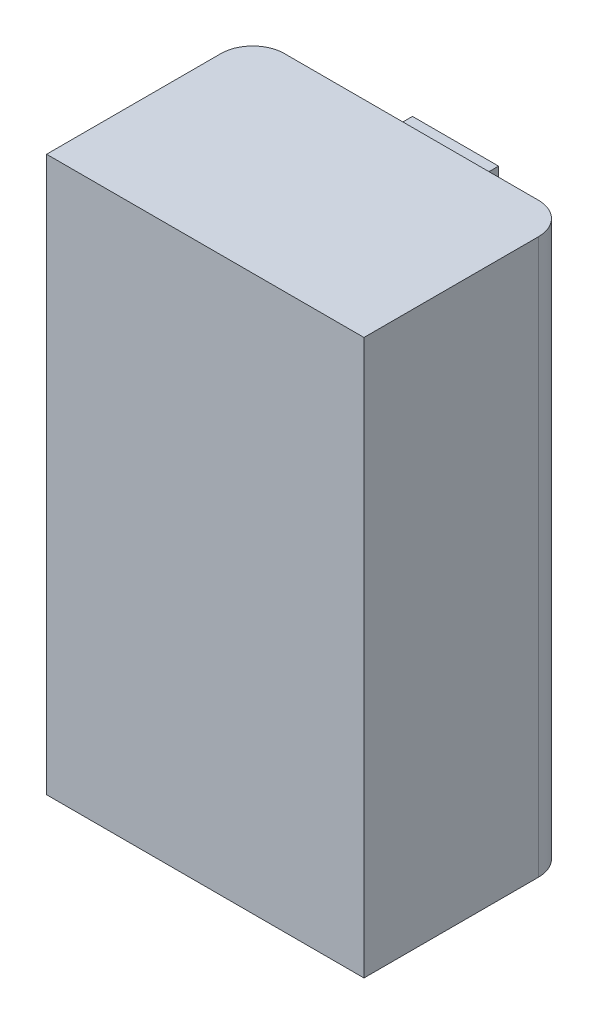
ISO-10303-21;
HEADER;
FILE_DESCRIPTION(('STEP AP214'),'2;1');
FILE_NAME('part.step','',(''),(''),'','','');
FILE_SCHEMA(('AUTOMOTIVE_DESIGN { 1 0 10303 214 1 1 1 1 }'));
ENDSEC;
DATA;
#1=APPLICATION_CONTEXT('core data for automotive mechanical design processes');
#2=APPLICATION_PROTOCOL_DEFINITION('international standard','automotive_design',2000,#1);
#3=PRODUCT_CONTEXT('',#1,'mechanical');
#4=PRODUCT('Part','Part','',(#3));
#5=PRODUCT_RELATED_PRODUCT_CATEGORY('part','',(#4));
#6=PRODUCT_DEFINITION_FORMATION('','',#4);
#7=PRODUCT_DEFINITION_CONTEXT('part definition',#1,'design');
#8=PRODUCT_DEFINITION('design','',#6,#7);
#9=PRODUCT_DEFINITION_SHAPE('','',#8);
#10=(LENGTH_UNIT() NAMED_UNIT(*) SI_UNIT(.MILLI.,.METRE.));
#11=(NAMED_UNIT(*) PLANE_ANGLE_UNIT() SI_UNIT($,.RADIAN.));
#12=(NAMED_UNIT(*) SI_UNIT($,.STERADIAN.) SOLID_ANGLE_UNIT());
#13=UNCERTAINTY_MEASURE_WITH_UNIT(LENGTH_MEASURE(1.E-05),#10,'distance_accuracy_value','');
#14=(GEOMETRIC_REPRESENTATION_CONTEXT(3) GLOBAL_UNCERTAINTY_ASSIGNED_CONTEXT((#13)) GLOBAL_UNIT_ASSIGNED_CONTEXT((#10,
#11,#12)) REPRESENTATION_CONTEXT('',''));
#15=CARTESIAN_POINT('',(0.,0.,0.));
#16=DIRECTION('',(0.,0.,1.));
#17=DIRECTION('',(1.,0.,0.));
#18=AXIS2_PLACEMENT_3D('',#15,#16,#17);
#19=CARTESIAN_POINT('',(0.,35.,-13.0038478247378));
#20=DIRECTION('',(0.,0.,1.));
#21=DIRECTION('',(1.,0.,0.));
#22=AXIS2_PLACEMENT_3D('',#19,#20,#21);
#23=PLANE('',#22);
#24=CARTESIAN_POINT('',(10.3424295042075,0.645554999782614,-13.0038478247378));
#25=CARTESIAN_POINT('',(10.3996068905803,0.647719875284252,-13.0038478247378));
#26=CARTESIAN_POINT('',(10.5139458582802,0.65204902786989,-13.0038478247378));
#27=CARTESIAN_POINT('',(10.6825857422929,0.689448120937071,-13.0038478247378));
#28=CARTESIAN_POINT('',(10.8460333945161,0.751236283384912,-13.0038478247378));
#29=CARTESIAN_POINT('',(11.0053798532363,0.835628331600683,-13.0038478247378));
#30=CARTESIAN_POINT('',(11.1597071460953,0.945138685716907,-13.0038478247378));
#31=CARTESIAN_POINT('',(11.308580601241,1.07935893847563,-13.0038478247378));
#32=CARTESIAN_POINT('',(11.4543746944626,1.23567829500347,-13.0038478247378));
#33=CARTESIAN_POINT('',(11.570231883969,1.38539932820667,-13.0038478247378));
#34=CARTESIAN_POINT('',(11.6615314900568,1.52299092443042,-13.0038478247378));
#35=CARTESIAN_POINT('',(11.7347723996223,1.64390549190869,-13.0038478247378));
#36=CARTESIAN_POINT('',(11.8098703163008,1.78175521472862,-13.0038478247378));
#37=CARTESIAN_POINT('',(11.8893758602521,1.93534751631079,-13.0038478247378));
#38=CARTESIAN_POINT('',(11.9702754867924,2.10628684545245,-13.0038478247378));
#39=CARTESIAN_POINT('',(12.0536513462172,2.29392774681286,-13.0038478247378));
#40=CARTESIAN_POINT('',(12.1414586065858,2.49750258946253,-13.0038478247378));
#41=CARTESIAN_POINT('',(12.2299187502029,2.71836398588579,-13.0038478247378));
#42=CARTESIAN_POINT('',(12.3238310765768,2.95478863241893,-13.0038478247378));
#43=CARTESIAN_POINT('',(12.4187159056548,3.2081923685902,-13.0038478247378));
#44=CARTESIAN_POINT('',(12.5162142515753,3.47827377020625,-13.0038478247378));
#45=CARTESIAN_POINT('',(12.617483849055,3.7647796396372,-13.0038478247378));
#46=CARTESIAN_POINT('',(12.722488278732,4.06762206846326,-13.0038478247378));
#47=CARTESIAN_POINT('',(12.8275940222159,4.38801156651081,-13.0038478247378));
#48=CARTESIAN_POINT('',(12.9371869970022,4.72408434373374,-13.0038478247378));
#49=CARTESIAN_POINT('',(13.0104661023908,4.95386548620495,-13.0038478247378));
#50=CARTESIAN_POINT('',(13.0479446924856,5.07138702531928,-13.0038478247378));
#51=B_SPLINE_CURVE_WITH_KNOTS('',3,(#24,#25,#26,#27,#28,#29,#30,#31,#32,#33,#34,#35,#36,#37,#38,
#39,#40,#41,#42,#43,#44,#45,#46,#47,#48,#49,#50),.UNSPECIFIED.,.F.,.F.,(4,1,1,1,1,1,1,1,1,1,1,1,
1,1,1,1,1,1,1,1,1,1,1,1,4),(0.,0.031327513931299,0.0626463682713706,0.09420106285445,
0.12691982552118,0.1612520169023,0.197696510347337,0.236659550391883,0.278338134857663,
0.301336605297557,0.327189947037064,0.355833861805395,0.387405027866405,0.422023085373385,
0.459522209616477,0.500004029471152,0.54359339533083,0.589986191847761,0.639508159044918,
0.691969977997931,0.747449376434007,0.806150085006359,0.867738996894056,0.932355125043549,1.),.UNSPECIFIED.);
#52=CARTESIAN_POINT('',(10.3424295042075,0.645554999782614,-13.0038478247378));
#53=VERTEX_POINT('',#52);
#54=CARTESIAN_POINT('',(13.0479446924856,5.07138702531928,-13.0038478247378));
#55=VERTEX_POINT('',#54);
#56=EDGE_CURVE('E384',#53,#55,#51,.T.);
#57=ORIENTED_EDGE('',*,*,#56,.T.);
#58=DIRECTION('',(0.,-1.,0.));
#59=VECTOR('',#58,1.);
#60=CARTESIAN_POINT('',(13.0479446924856,5.07138702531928,-13.0038478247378));
#61=LINE('',#60,#59);
#62=CARTESIAN_POINT('',(13.0479446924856,0.669981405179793,-13.0038478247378));
#63=VERTEX_POINT('',#62);
#64=EDGE_CURVE('E1274',#55,#63,#61,.T.);
#65=ORIENTED_EDGE('',*,*,#64,.T.);
#66=DIRECTION('',(1.,0.,0.));
#67=VECTOR('',#66,1.);
#68=CARTESIAN_POINT('',(13.0479446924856,0.669981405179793,-13.0038478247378));
#69=LINE('',#68,#67);
#70=CARTESIAN_POINT('',(14.0156956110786,0.669981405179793,-13.0038478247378));
#71=VERTEX_POINT('',#70);
#72=EDGE_CURVE('E363',#63,#71,#69,.T.);
#73=ORIENTED_EDGE('',*,*,#72,.T.);
#74=DIRECTION('',(0.,1.,0.));
#75=VECTOR('',#74,1.);
#76=CARTESIAN_POINT('',(14.0156956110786,0.669981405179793,-13.0038478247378));
#77=LINE('',#76,#75);
#78=CARTESIAN_POINT('',(14.0156956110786,7.22091070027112,-13.0038478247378));
#79=VERTEX_POINT('',#78);
#80=EDGE_CURVE('E50',#71,#79,#77,.T.);
#81=ORIENTED_EDGE('',*,*,#80,.T.);
#82=DIRECTION('',(-1.,0.,0.));
#83=VECTOR('',#82,1.);
#84=CARTESIAN_POINT('',(14.0156956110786,7.22091070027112,-13.0038478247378));
#85=LINE('',#84,#83);
#86=CARTESIAN_POINT('',(12.9979287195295,7.22091070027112,-13.0038478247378));
#87=VERTEX_POINT('',#86);
#88=EDGE_CURVE('E1281',#79,#87,#85,.T.);
#89=ORIENTED_EDGE('',*,*,#88,.T.);
#90=DIRECTION('',(-0.376090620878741,-0.926582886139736,0.));
#91=VECTOR('',#90,1.);
#92=CARTESIAN_POINT('',(12.9979287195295,7.22091070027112,-13.0038478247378));
#93=LINE('',#92,#91);
#94=CARTESIAN_POINT('',(11.8917615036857,4.49562175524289,-13.0038478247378));
#95=VERTEX_POINT('',#94);
#96=EDGE_CURVE('E1284',#87,#95,#93,.T.);
#97=ORIENTED_EDGE('',*,*,#96,.T.);
#98=CARTESIAN_POINT('',(11.8917615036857,4.49562175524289,-13.0038478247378));
#99=CARTESIAN_POINT('',(11.8506995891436,4.39657234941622,-13.0038478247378));
#100=CARTESIAN_POINT('',(11.7719467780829,4.20660509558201,-13.0038478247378));
#101=CARTESIAN_POINT('',(11.6517811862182,3.93587566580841,-13.0038478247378));
#102=CARTESIAN_POINT('',(11.5361840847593,3.69095487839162,-13.0038478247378));
#103=CARTESIAN_POINT('',(11.4242511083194,3.47131690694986,-13.0038478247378));
#104=CARTESIAN_POINT('',(11.3172203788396,3.27695141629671,-13.0038478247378));
#105=CARTESIAN_POINT('',(11.2122583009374,3.10918990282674,-13.0038478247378));
#106=CARTESIAN_POINT('',(11.1130649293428,2.96593292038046,-13.0038478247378));
#107=CARTESIAN_POINT('',(11.0151755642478,2.84817031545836,-13.0038478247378));
#108=CARTESIAN_POINT('',(10.9203956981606,2.74973730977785,-13.0038478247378));
#109=CARTESIAN_POINT('',(10.8286804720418,2.66679292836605,-13.0038478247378));
#110=CARTESIAN_POINT('',(10.7413000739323,2.59409245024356,-13.0038478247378));
#111=CARTESIAN_POINT('',(10.6552785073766,2.53625228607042,-13.0038478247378));
#112=CARTESIAN_POINT('',(10.5720585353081,2.48952764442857,-13.0038478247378));
#113=CARTESIAN_POINT('',(10.4912150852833,2.45686982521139,-13.0038478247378));
#114=CARTESIAN_POINT('',(10.412390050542,2.43691929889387,-13.0038478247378));
#115=CARTESIAN_POINT('',(10.360756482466,2.43373347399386,-13.0038478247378));
#116=CARTESIAN_POINT('',(10.3354505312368,2.43217208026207,-13.0038478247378));
#117=B_SPLINE_CURVE_WITH_KNOTS('',3,(#98,#99,#100,#101,#102,#103,#104,#105,#106,#107,#108,#109,
#110,#111,#112,#113,#114,#115,#116),.UNSPECIFIED.,.F.,.F.,(4,1,1,1,1,1,1,1,1,1,1,1,1,1,1,1,4),
(0.,0.119564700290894,0.229313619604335,0.330268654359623,0.421536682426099,0.504182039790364,
0.577601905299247,0.642138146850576,0.69832672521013,0.748168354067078,0.794382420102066,
0.836180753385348,0.874794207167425,0.909818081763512,0.942414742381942,0.971777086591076,1.),.UNSPECIFIED.);
#118=CARTESIAN_POINT('',(10.3354505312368,2.43217208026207,-13.0038478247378));
#119=VERTEX_POINT('',#118);
#120=EDGE_CURVE('E1287',#95,#119,#117,.T.);
#121=ORIENTED_EDGE('',*,*,#120,.T.);
#122=CARTESIAN_POINT('',(10.3354505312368,2.43217208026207,-13.0038478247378));
#123=CARTESIAN_POINT('',(10.3062711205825,2.43317921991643,-13.0038478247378));
#124=CARTESIAN_POINT('',(10.2484597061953,2.43517460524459,-13.0038478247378));
#125=CARTESIAN_POINT('',(10.1636547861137,2.45458903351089,-13.0038478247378));
#126=CARTESIAN_POINT('',(10.0823129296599,2.48662665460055,-13.0038478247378));
#127=CARTESIAN_POINT('',(10.0042901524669,2.53081941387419,-13.0038478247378));
#128=CARTESIAN_POINT('',(9.93053268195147,2.58852825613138,-13.0038478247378));
#129=CARTESIAN_POINT('',(9.85733858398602,2.65537072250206,-13.0038478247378));
#130=CARTESIAN_POINT('',(9.7909727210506,2.738407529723,-13.0038478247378));
#131=CARTESIAN_POINT('',(9.72567812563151,2.83054161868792,-13.0038478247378));
#132=CARTESIAN_POINT('',(9.66670285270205,2.93368597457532,-13.0038478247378));
#133=CARTESIAN_POINT('',(9.61605737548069,3.04581004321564,-13.0038478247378));
#134=CARTESIAN_POINT('',(9.57115038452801,3.16521248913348,-13.0038478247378));
#135=CARTESIAN_POINT('',(9.53535668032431,3.29283199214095,-13.0038478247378));
#136=CARTESIAN_POINT('',(9.50898525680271,3.42911110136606,-13.0038478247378));
#137=CARTESIAN_POINT('',(9.48971486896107,3.57281739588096,-13.0038478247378));
#138=CARTESIAN_POINT('',(9.47592607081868,3.72456875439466,-13.0038478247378));
#139=CARTESIAN_POINT('',(9.4751222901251,3.82832180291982,-13.0038478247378));
#140=CARTESIAN_POINT('',(9.47471053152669,3.88147213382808,-13.0038478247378));
#141=B_SPLINE_CURVE_WITH_KNOTS('',3,(#122,#123,#124,#125,#126,#127,#128,#129,#130,#131,#132,
#133,#134,#135,#136,#137,#138,#139,#140),.UNSPECIFIED.,.F.,.F.,(4,1,1,1,1,1,1,1,1,1,1,1,1,1,1,1,
4),(0.,0.0471282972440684,0.0933724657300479,0.139828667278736,0.188122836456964,
0.237781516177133,0.291012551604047,0.348009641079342,0.409236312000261,0.473550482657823,
0.539762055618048,0.608008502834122,0.679663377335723,0.75380955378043,0.832282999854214,
0.914082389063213,1.),.UNSPECIFIED.);
#142=CARTESIAN_POINT('',(9.47471053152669,3.88147213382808,-13.0038478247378));
#143=VERTEX_POINT('',#142);
#144=EDGE_CURVE('E1292',#119,#143,#141,.T.);
#145=ORIENTED_EDGE('',*,*,#144,.T.);
#146=CARTESIAN_POINT('',(9.47471053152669,3.88147213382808,-13.0038478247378));
#147=CARTESIAN_POINT('',(9.47568114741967,3.93616188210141,-13.0038478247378));
#148=CARTESIAN_POINT('',(9.47757692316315,4.04298013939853,-13.0038478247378));
#149=CARTESIAN_POINT('',(9.49006191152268,4.19884911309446,-13.0038478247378));
#150=CARTESIAN_POINT('',(9.51233394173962,4.34564419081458,-13.0038478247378));
#151=CARTESIAN_POINT('',(9.54211824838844,4.4838742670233,-13.0038478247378));
#152=CARTESIAN_POINT('',(9.58180482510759,4.61288935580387,-13.0038478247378));
#153=CARTESIAN_POINT('',(9.62928130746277,4.7338775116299,-13.0038478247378));
#154=CARTESIAN_POINT('',(9.68683972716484,4.84561207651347,-13.0038478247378));
#155=CARTESIAN_POINT('',(9.75114166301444,4.94990045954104,-13.0038478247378));
#156=CARTESIAN_POINT('',(9.82687777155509,5.04328017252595,-13.0038478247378));
#157=CARTESIAN_POINT('',(9.90974510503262,5.12906654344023,-13.0038478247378));
#158=CARTESIAN_POINT('',(10.0017926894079,5.20583972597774,-13.0038478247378));
#159=CARTESIAN_POINT('',(10.1028808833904,5.27375628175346,-13.0038478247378));
#160=CARTESIAN_POINT('',(10.2122757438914,5.33305414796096,-13.0038478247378));
#161=CARTESIAN_POINT('',(10.3306452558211,5.38330527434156,-13.0038478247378));
#162=CARTESIAN_POINT('',(10.4577417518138,5.42390938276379,-13.0038478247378));
#163=CARTESIAN_POINT('',(10.5461997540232,5.4438766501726,-13.0038478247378));
#164=CARTESIAN_POINT('',(10.5913462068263,5.45406737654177,-13.0038478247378));
#165=B_SPLINE_CURVE_WITH_KNOTS('',3,(#146,#147,#148,#149,#150,#151,#152,#153,#154,#155,#156,
#157,#158,#159,#160,#161,#162,#163,#164),.UNSPECIFIED.,.F.,.F.,(4,1,1,1,1,1,1,1,1,1,1,1,1,1,1,1,
4),(0.,0.0772857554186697,0.15095205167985,0.220768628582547,0.286972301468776,
0.350578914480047,0.411319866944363,0.470374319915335,0.527987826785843,0.584120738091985,
0.639915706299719,0.696318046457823,0.753152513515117,0.81174766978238,0.871892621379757,
0.934617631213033,1.),.UNSPECIFIED.);
#166=CARTESIAN_POINT('',(10.5913462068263,5.45406737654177,-13.0038478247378));
#167=VERTEX_POINT('',#166);
#168=EDGE_CURVE('E1300',#143,#167,#165,.T.);
#169=ORIENTED_EDGE('',*,*,#168,.T.);
#170=DIRECTION('',(-0.131821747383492,0.991273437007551,0.));
#171=VECTOR('',#170,1.);
#172=CARTESIAN_POINT('',(10.5913462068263,5.45406737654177,-13.0038478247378));
#173=LINE('',#172,#171);
#174=CARTESIAN_POINT('',(10.3563874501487,7.22091070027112,-13.0038478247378));
#175=VERTEX_POINT('',#174);
#176=EDGE_CURVE('E1308',#167,#175,#173,.T.);
#177=ORIENTED_EDGE('',*,*,#176,.T.);
#178=CARTESIAN_POINT('',(10.3563874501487,7.22091070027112,-13.0038478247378));
#179=CARTESIAN_POINT('',(10.2896358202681,7.20376723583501,-13.0038478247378));
#180=CARTESIAN_POINT('',(10.1564432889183,7.16956010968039,-13.0038478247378));
#181=CARTESIAN_POINT('',(9.96489278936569,7.09202503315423,-13.0038478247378));
#182=CARTESIAN_POINT('',(9.7834643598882,6.99166343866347,-13.0038478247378));
#183=CARTESIAN_POINT('',(9.61023496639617,6.87188629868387,-13.0038478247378));
#184=CARTESIAN_POINT('',(9.44833627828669,6.72831652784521,-13.0038478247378));
#185=CARTESIAN_POINT('',(9.29506199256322,6.56454986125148,-13.0038478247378));
#186=CARTESIAN_POINT('',(9.1523322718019,6.37856048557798,-13.0038478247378));
#187=CARTESIAN_POINT('',(9.01892690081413,6.17306764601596,-13.0038478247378));
#188=CARTESIAN_POINT('',(8.89757475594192,5.94871399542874,-13.0038478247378));
#189=CARTESIAN_POINT('',(8.79401530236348,5.70601242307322,-13.0038478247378));
#190=CARTESIAN_POINT('',(8.70316974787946,5.44805396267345,-13.0038478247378));
#191=CARTESIAN_POINT('',(8.63255909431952,5.17258181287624,-13.0038478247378));
#192=CARTESIAN_POINT('',(8.57471529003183,4.88149425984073,-13.0038478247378));
#193=CARTESIAN_POINT('',(8.53663856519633,4.57318993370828,-13.0038478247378));
#194=CARTESIAN_POINT('',(8.51126825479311,4.24907031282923,-13.0038478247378));
#195=CARTESIAN_POINT('',(8.50841626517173,4.0273064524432,-13.0038478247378));
#196=CARTESIAN_POINT('',(8.50695961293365,3.91404067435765,-13.0038478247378));
#197=B_SPLINE_CURVE_WITH_KNOTS('',3,(#178,#179,#180,#181,#182,#183,#184,#185,#186,#187,#188,
#189,#190,#191,#192,#193,#194,#195,#196),.UNSPECIFIED.,.F.,.F.,(4,1,1,1,1,1,1,1,1,1,1,1,1,1,1,1,
4),(0.,0.0505004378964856,0.100765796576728,0.151029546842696,0.202298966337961,
0.254885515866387,0.30940145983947,0.366559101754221,0.426575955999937,0.488912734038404,
0.553353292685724,0.619896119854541,0.689276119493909,0.761712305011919,0.837396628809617,
0.916950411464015,1.),.UNSPECIFIED.);
#198=CARTESIAN_POINT('',(8.50695961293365,3.91404067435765,-13.0038478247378));
#199=VERTEX_POINT('',#198);
#200=EDGE_CURVE('E1314',#175,#199,#197,.T.);
#201=ORIENTED_EDGE('',*,*,#200,.T.);
#202=CARTESIAN_POINT('',(8.50695961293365,3.91404067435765,-13.0038478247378));
#203=CARTESIAN_POINT('',(8.50842397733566,3.7938009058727,-13.0038478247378));
#204=CARTESIAN_POINT('',(8.5112803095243,3.55926589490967,-13.0038478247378));
#205=CARTESIAN_POINT('',(8.53635985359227,3.21646961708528,-13.0038478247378));
#206=CARTESIAN_POINT('',(8.57581276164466,2.89156613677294,-13.0038478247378));
#207=CARTESIAN_POINT('',(8.63458429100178,2.58531106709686,-13.0038478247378));
#208=CARTESIAN_POINT('',(8.70678912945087,2.29642472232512,-13.0038478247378));
#209=CARTESIAN_POINT('',(8.79805520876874,2.02657996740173,-13.0038478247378));
#210=CARTESIAN_POINT('',(8.90302459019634,1.77364203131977,-13.0038478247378));
#211=CARTESIAN_POINT('',(9.0262523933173,1.54241953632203,-13.0038478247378));
#212=CARTESIAN_POINT('',(9.15978908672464,1.33328339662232,-13.0038478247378));
#213=CARTESIAN_POINT('',(9.30348080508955,1.15050975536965,-13.0038478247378));
#214=CARTESIAN_POINT('',(9.45430841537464,0.993602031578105,-13.0038478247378));
#215=CARTESIAN_POINT('',(9.61609975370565,0.867219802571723,-13.0038478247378));
#216=CARTESIAN_POINT('',(9.78535729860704,0.767082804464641,-13.0038478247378));
#217=CARTESIAN_POINT('',(9.96366288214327,0.697309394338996,-13.0038478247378));
#218=CARTESIAN_POINT('',(10.1503086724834,0.653179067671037,-13.0038478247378));
#219=CARTESIAN_POINT('',(10.2778219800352,0.648118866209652,-13.0038478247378));
#220=CARTESIAN_POINT('',(10.3424295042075,0.645554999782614,-13.0038478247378));
#221=B_SPLINE_CURVE_WITH_KNOTS('',3,(#202,#203,#204,#205,#206,#207,#208,#209,#210,#211,#212,
#213,#214,#215,#216,#217,#218,#219,#220),.UNSPECIFIED.,.F.,.F.,(4,1,1,1,1,1,1,1,1,1,1,1,1,1,1,1,
4),(0.,0.0874260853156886,0.170529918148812,0.249809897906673,0.325290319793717,
0.397161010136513,0.46617085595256,0.532255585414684,0.596075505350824,0.656451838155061,
0.712463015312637,0.764899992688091,0.814307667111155,0.861310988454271,0.907385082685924,
0.953074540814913,1.),.UNSPECIFIED.);
#222=EDGE_CURVE('E387',#199,#53,#221,.T.);
#223=ORIENTED_EDGE('',*,*,#222,.T.);
#224=EDGE_LOOP('',(#57,#65,#73,#81,#89,#97,#121,#145,#169,#177,#201,#223));
#225=FACE_BOUND('',#224,.T.);
#226=DIRECTION('',(0.76009213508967,0.64981531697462,0.));
#227=VECTOR('',#226,1.);
#228=CARTESIAN_POINT('',(8.58140199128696,11.0979554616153,-13.0038478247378));
#229=LINE('',#228,#227);
#230=CARTESIAN_POINT('',(8.58140199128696,11.0979554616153,-13.0038478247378));
#231=VERTEX_POINT('',#230);
#232=CARTESIAN_POINT('',(11.7161240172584,13.7778810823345,-13.0038478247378));
#233=VERTEX_POINT('',#232);
#234=EDGE_CURVE('E1359',#231,#233,#229,.T.);
#235=ORIENTED_EDGE('',*,*,#234,.T.);
#236=DIRECTION('',(1.,0.,0.));
#237=VECTOR('',#236,1.);
#238=CARTESIAN_POINT('',(11.7161240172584,13.7778810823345,-13.0038478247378));
#239=LINE('',#238,#237);
#240=CARTESIAN_POINT('',(14.0156956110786,13.7778810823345,-13.0038478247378));
#241=VERTEX_POINT('',#240);
#242=EDGE_CURVE('E1335',#233,#241,#239,.T.);
#243=ORIENTED_EDGE('',*,*,#242,.T.);
#244=DIRECTION('',(0.,1.,0.));
#245=VECTOR('',#244,1.);
#246=CARTESIAN_POINT('',(14.0156956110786,13.7778810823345,-13.0038478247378));
#247=LINE('',#246,#245);
#248=CARTESIAN_POINT('',(14.0156956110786,15.6389405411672,-13.0038478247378));
#249=VERTEX_POINT('',#248);
#250=EDGE_CURVE('E1386',#241,#249,#247,.T.);
#251=ORIENTED_EDGE('',*,*,#250,.T.);
#252=DIRECTION('',(-1.,0.,0.));
#253=VECTOR('',#252,1.);
#254=CARTESIAN_POINT('',(14.0156956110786,15.6389405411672,-13.0038478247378));
#255=LINE('',#254,#253);
#256=CARTESIAN_POINT('',(11.7393872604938,15.6389405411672,-13.0038478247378));
#257=VERTEX_POINT('',#256);
#258=EDGE_CURVE('E58',#249,#257,#255,.T.);
#259=ORIENTED_EDGE('',*,*,#258,.T.);
#260=DIRECTION('',(-0.736174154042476,0.676792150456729,0.));
#261=VECTOR('',#260,1.);
#262=CARTESIAN_POINT('',(11.7393872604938,15.6389405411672,-13.0038478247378));
#263=LINE('',#262,#261);
#264=CARTESIAN_POINT('',(8.58140199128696,18.5421932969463,-13.0038478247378));
#265=VERTEX_POINT('',#264);
#266=EDGE_CURVE('E1390',#257,#265,#263,.T.);
#267=ORIENTED_EDGE('',*,*,#266,.T.);
#268=DIRECTION('',(0.,-1.,0.));
#269=VECTOR('',#268,1.);
#270=CARTESIAN_POINT('',(8.58140199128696,18.5421932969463,-13.0038478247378));
#271=LINE('',#270,#269);
#272=CARTESIAN_POINT('',(8.58140199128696,16.5229437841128,-13.0038478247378));
#273=VERTEX_POINT('',#272);
#274=EDGE_CURVE('E1393',#265,#273,#271,.T.);
#275=ORIENTED_EDGE('',*,*,#274,.T.);
#276=DIRECTION('',(0.735324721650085,-0.677714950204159,0.));
#277=VECTOR('',#276,1.);
#278=CARTESIAN_POINT('',(8.58140199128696,16.5229437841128,-13.0038478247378));
#279=LINE('',#278,#277);
#280=CARTESIAN_POINT('',(10.7192940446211,14.5525470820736,-13.0038478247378));
#281=VERTEX_POINT('',#280);
#282=EDGE_CURVE('E1396',#273,#281,#279,.T.);
#283=ORIENTED_EDGE('',*,*,#282,.T.);
#284=DIRECTION('',(-0.761591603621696,-0.648057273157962,0.));
#285=VECTOR('',#284,1.);
#286=CARTESIAN_POINT('',(10.7192940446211,14.5525470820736,-13.0038478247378));
#287=LINE('',#286,#285);
#288=CARTESIAN_POINT('',(8.58140199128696,12.7333614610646,-13.0038478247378));
#289=VERTEX_POINT('',#288);
#290=EDGE_CURVE('E1399',#281,#289,#287,.T.);
#291=ORIENTED_EDGE('',*,*,#290,.T.);
#292=DIRECTION('',(0.,-1.,0.));
#293=VECTOR('',#292,1.);
#294=CARTESIAN_POINT('',(8.58140199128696,12.7333614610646,-13.0038478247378));
#295=LINE('',#294,#293);
#296=EDGE_CURVE('E1402',#289,#231,#295,.T.);
#297=ORIENTED_EDGE('',*,*,#296,.T.);
#298=EDGE_LOOP('',(#235,#243,#251,#259,#267,#275,#283,#291,#297));
#299=FACE_BOUND('',#298,.T.);
#300=DIRECTION('',(-1.,0.,0.));
#301=VECTOR('',#300,1.);
#302=CARTESIAN_POINT('',(12.0592568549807,20.7040428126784,-13.0038478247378));
#303=LINE('',#302,#301);
#304=CARTESIAN_POINT('',(12.0592568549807,20.7040428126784,-13.0038478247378));
#305=VERTEX_POINT('',#304);
#306=CARTESIAN_POINT('',(8.58140199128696,20.7040428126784,-13.0038478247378));
#307=VERTEX_POINT('',#306);
#308=EDGE_CURVE('E555',#305,#307,#303,.T.);
#309=ORIENTED_EDGE('',*,*,#308,.T.);
#310=DIRECTION('',(0.,-1.,0.));
#311=VECTOR('',#310,1.);
#312=CARTESIAN_POINT('',(8.58140199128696,20.7040428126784,-13.0038478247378));
#313=LINE('',#312,#311);
#314=CARTESIAN_POINT('',(8.58140199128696,19.2896376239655,-13.0038478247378));
#315=VERTEX_POINT('',#314);
#316=EDGE_CURVE('E510',#307,#315,#313,.T.);
#317=ORIENTED_EDGE('',*,*,#316,.T.);
#318=DIRECTION('',(1.,0.,0.));
#319=VECTOR('',#318,1.);
#320=CARTESIAN_POINT('',(8.58140199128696,19.2896376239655,-13.0038478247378));
#321=LINE('',#320,#319);
#322=CARTESIAN_POINT('',(12.047625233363,19.2896376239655,-13.0038478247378));
#323=VERTEX_POINT('',#322);
#324=EDGE_CURVE('E513',#315,#323,#321,.T.);
#325=ORIENTED_EDGE('',*,*,#324,.T.);
#326=CARTESIAN_POINT('',(12.047625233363,19.2896376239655,-13.0038478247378));
#327=CARTESIAN_POINT('',(12.1038581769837,19.2907062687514,-13.0038478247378));
#328=CARTESIAN_POINT('',(12.2129560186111,19.2927795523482,-13.0038478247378));
#329=CARTESIAN_POINT('',(12.372325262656,19.3037781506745,-13.0038478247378));
#330=CARTESIAN_POINT('',(12.521689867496,19.3252152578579,-13.0038478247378));
#331=CARTESIAN_POINT('',(12.6627339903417,19.3522756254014,-13.0038478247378));
#332=CARTESIAN_POINT('',(12.7934576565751,19.3899120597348,-13.0038478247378));
#333=CARTESIAN_POINT('',(12.9158920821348,19.4333805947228,-13.0038478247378));
#334=CARTESIAN_POINT('',(13.0273901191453,19.4876596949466,-13.0038478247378));
#335=CARTESIAN_POINT('',(13.1325891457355,19.5484457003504,-13.0038478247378));
#336=CARTESIAN_POINT('',(13.229948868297,19.6229597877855,-13.0038478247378));
#337=CARTESIAN_POINT('',(13.3228830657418,19.7116680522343,-13.0038478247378));
#338=CARTESIAN_POINT('',(13.4120982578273,19.8155320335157,-13.0038478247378));
#339=CARTESIAN_POINT('',(13.4981753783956,19.9347530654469,-13.0038478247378));
#340=CARTESIAN_POINT('',(13.5806958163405,20.0695989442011,-13.0038478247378));
#341=CARTESIAN_POINT('',(13.6606894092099,20.2189579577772,-13.0038478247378));
#342=CARTESIAN_POINT('',(13.7359694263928,20.3845139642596,-13.0038478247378));
#343=CARTESIAN_POINT('',(13.809362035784,20.5632241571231,-13.0038478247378));
#344=CARTESIAN_POINT('',(13.8748293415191,20.7556211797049,-13.0038478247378));
#345=CARTESIAN_POINT('',(13.9332217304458,20.9581104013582,-13.0038478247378));
#346=CARTESIAN_POINT('',(13.9821267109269,21.1705067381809,-13.0038478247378));
#347=CARTESIAN_POINT('',(14.0208757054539,21.3923326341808,-13.0038478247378));
#348=CARTESIAN_POINT('',(14.0528900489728,21.6238764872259,-13.0038478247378));
#349=CARTESIAN_POINT('',(14.0744135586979,21.8649272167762,-13.0038478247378));
#350=CARTESIAN_POINT('',(14.0873081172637,22.1159795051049,-13.0038478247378));
#351=CARTESIAN_POINT('',(14.089182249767,22.286315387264,-13.0038478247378));
#352=CARTESIAN_POINT('',(14.0901379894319,22.373180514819,-13.0038478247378));
#353=B_SPLINE_CURVE_WITH_KNOTS('',3,(#326,#327,#328,#329,#330,#331,#332,#333,#334,#335,#336,
#337,#338,#339,#340,#341,#342,#343,#344,#345,#346,#347,#348,#349,#350,#351,#352),.UNSPECIFIED.,
.F.,.F.,(4,1,1,1,1,1,1,1,1,1,1,1,1,1,1,1,1,1,1,1,1,1,1,1,4),(0.,0.040102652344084,
0.0778033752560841,0.113812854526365,0.147645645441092,0.180114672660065,0.210726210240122,
0.240156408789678,0.268415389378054,0.297223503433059,0.327339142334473,0.359875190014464,
0.394714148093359,0.432078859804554,0.472524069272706,0.515448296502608,0.561704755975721,
0.610228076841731,0.660279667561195,0.711918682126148,0.76555357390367,0.820800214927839,
0.878544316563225,0.938062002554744,1.),.UNSPECIFIED.);
#354=CARTESIAN_POINT('',(14.0901379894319,22.373180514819,-13.0038478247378));
#355=VERTEX_POINT('',#354);
#356=EDGE_CURVE('E517',#323,#355,#353,.T.);
#357=ORIENTED_EDGE('',*,*,#356,.T.);
#358=CARTESIAN_POINT('',(14.0901379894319,22.373180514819,-13.0038478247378));
#359=CARTESIAN_POINT('',(14.0895976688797,22.4584936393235,-13.0038478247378));
#360=CARTESIAN_POINT('',(14.0885385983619,22.6257140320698,-13.0038478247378));
#361=CARTESIAN_POINT('',(14.0764682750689,22.8704863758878,-13.0038478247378));
#362=CARTESIAN_POINT('',(14.0579633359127,23.1040147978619,-13.0038478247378));
#363=CARTESIAN_POINT('',(14.03300010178,23.326091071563,-13.0038478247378));
#364=CARTESIAN_POINT('',(13.9991320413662,23.5367560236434,-13.0038478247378));
#365=CARTESIAN_POINT('',(13.9583846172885,23.7362238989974,-13.0038478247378));
#366=CARTESIAN_POINT('',(13.9115305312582,23.9244671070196,-13.0038478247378));
#367=CARTESIAN_POINT('',(13.8555820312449,24.100717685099,-13.0038478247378));
#368=CARTESIAN_POINT('',(13.7919628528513,24.2647217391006,-13.0038478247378));
#369=CARTESIAN_POINT('',(13.7259633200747,24.4188374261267,-13.0038478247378));
#370=CARTESIAN_POINT('',(13.6505226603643,24.5594431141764,-13.0038478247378));
#371=CARTESIAN_POINT('',(13.5721032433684,24.689934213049,-13.0038478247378));
#372=CARTESIAN_POINT('',(13.4853858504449,24.8069200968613,-13.0038478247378));
#373=CARTESIAN_POINT('',(13.3952767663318,24.914349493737,-13.0038478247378));
#374=CARTESIAN_POINT('',(13.2963137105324,25.0068843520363,-13.0038478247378));
#375=CARTESIAN_POINT('',(13.1940574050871,25.0910709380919,-13.0038478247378));
#376=CARTESIAN_POINT('',(13.0828097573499,25.1619953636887,-13.0038478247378));
#377=CARTESIAN_POINT('',(12.9660710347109,25.2249547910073,-13.0038478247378));
#378=CARTESIAN_POINT('',(12.8413476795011,25.2775076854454,-13.0038478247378));
#379=CARTESIAN_POINT('',(12.7103009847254,25.3205869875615,-13.0038478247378));
#380=CARTESIAN_POINT('',(12.5715585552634,25.3526538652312,-13.0038478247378));
#381=CARTESIAN_POINT('',(12.4267879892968,25.3774410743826,-13.0038478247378));
#382=CARTESIAN_POINT('',(12.274326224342,25.3913235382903,-13.0038478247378));
#383=CARTESIAN_POINT('',(12.1705595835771,25.3930357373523,-13.0038478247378));
#384=CARTESIAN_POINT('',(12.1174149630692,25.3939126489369,-13.0038478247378));
#385=B_SPLINE_CURVE_WITH_KNOTS('',3,(#358,#359,#360,#361,#362,#363,#364,#365,#366,#367,#368,
#369,#370,#371,#372,#373,#374,#375,#376,#377,#378,#379,#380,#381,#382,#383,#384),.UNSPECIFIED.,
.F.,.F.,(4,1,1,1,1,1,1,1,1,1,1,1,1,1,1,1,1,1,1,1,1,1,1,1,4),(0.,0.0625021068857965,
0.122509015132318,0.179505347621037,0.2341222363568,0.286195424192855,0.335779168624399,
0.383250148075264,0.428260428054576,0.471151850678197,0.512109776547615,0.55099473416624,
0.587973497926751,0.623541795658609,0.657589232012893,0.690541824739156,0.722662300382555,
0.75449507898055,0.787029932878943,0.819742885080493,0.853520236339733,0.887971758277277,
0.923978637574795,0.961065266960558,1.),.UNSPECIFIED.);
#386=CARTESIAN_POINT('',(12.1174149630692,25.3939126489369,-13.0038478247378));
#387=VERTEX_POINT('',#386);
#388=EDGE_CURVE('E522',#355,#387,#385,.T.);
#389=ORIENTED_EDGE('',*,*,#388,.T.);
#390=DIRECTION('',(-1.,0.,0.));
#391=VECTOR('',#390,1.);
#392=CARTESIAN_POINT('',(12.1174149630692,25.3939126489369,-13.0038478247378));
#393=LINE('',#392,#391);
#394=CARTESIAN_POINT('',(8.58140199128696,25.3939126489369,-13.0038478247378));
#395=VERTEX_POINT('',#394);
#396=EDGE_CURVE('E530',#387,#395,#393,.T.);
#397=ORIENTED_EDGE('',*,*,#396,.T.);
#398=DIRECTION('',(0.,-1.,0.));
#399=VECTOR('',#398,1.);
#400=CARTESIAN_POINT('',(8.58140199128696,25.3939126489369,-13.0038478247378));
#401=LINE('',#400,#399);
#402=CARTESIAN_POINT('',(8.58140199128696,23.6072955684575,-13.0038478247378));
#403=VERTEX_POINT('',#402);
#404=EDGE_CURVE('E536',#395,#403,#401,.T.);
#405=ORIENTED_EDGE('',*,*,#404,.T.);
#406=DIRECTION('',(1.,0.,0.));
#407=VECTOR('',#406,1.);
#408=CARTESIAN_POINT('',(8.58140199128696,23.6072955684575,-13.0038478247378));
#409=LINE('',#408,#407);
#410=CARTESIAN_POINT('',(12.0592568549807,23.6072955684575,-13.0038478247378));
#411=VERTEX_POINT('',#410);
#412=EDGE_CURVE('E539',#403,#411,#409,.T.);
#413=ORIENTED_EDGE('',*,*,#412,.T.);
#414=CARTESIAN_POINT('',(12.0592568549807,23.6072955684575,-13.0038478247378));
#415=CARTESIAN_POINT('',(12.1128040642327,23.6058186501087,-13.0038478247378));
#416=CARTESIAN_POINT('',(12.2155882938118,23.6029836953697,-13.0038478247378));
#417=CARTESIAN_POINT('',(12.3624639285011,23.5854373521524,-13.0038478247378));
#418=CARTESIAN_POINT('',(12.4943256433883,23.552496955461,-13.0038478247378));
#419=CARTESIAN_POINT('',(12.6121182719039,23.5079790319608,-13.0038478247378));
#420=CARTESIAN_POINT('',(12.7142345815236,23.4479501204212,-13.0038478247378));
#421=CARTESIAN_POINT('',(12.8024058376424,23.3759367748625,-13.0038478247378));
#422=CARTESIAN_POINT('',(12.8758019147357,23.2904700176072,-13.0038478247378));
#423=CARTESIAN_POINT('',(12.9490728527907,23.1560357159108,-13.0038478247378));
#424=CARTESIAN_POINT('',(13.0187012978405,22.970682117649,-13.0038478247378));
#425=CARTESIAN_POINT('',(13.0785531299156,22.730908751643,-13.0038478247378));
#426=CARTESIAN_POINT('',(13.1169322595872,22.471337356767,-13.0038478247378));
#427=CARTESIAN_POINT('',(13.120530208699,22.2915120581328,-13.0038478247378));
#428=CARTESIAN_POINT('',(13.1223870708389,22.1987061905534,-13.0038478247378));
#429=B_SPLINE_CURVE_WITH_KNOTS('',3,(#414,#415,#416,#417,#418,#419,#420,#421,#422,#423,#424,
#425,#426,#427,#428),.UNSPECIFIED.,.F.,.F.,(4,1,1,1,1,1,1,1,1,1,1,1,4),(0.,0.0787994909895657,
0.151256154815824,0.217115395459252,0.278347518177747,0.335877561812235,0.390586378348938,
0.44522376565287,0.500415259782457,0.614933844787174,0.735584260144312,0.863537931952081,1.),.UNSPECIFIED.);
#430=CARTESIAN_POINT('',(13.1223870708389,22.1987061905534,-13.0038478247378));
#431=VERTEX_POINT('',#430);
#432=EDGE_CURVE('E542',#411,#431,#429,.T.);
#433=ORIENTED_EDGE('',*,*,#432,.T.);
#434=CARTESIAN_POINT('',(13.1223870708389,22.1987061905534,-13.0038478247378));
#435=CARTESIAN_POINT('',(13.1217288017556,22.1424729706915,-13.0038478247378));
#436=CARTESIAN_POINT('',(13.1204428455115,22.0326190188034,-13.0038478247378));
#437=CARTESIAN_POINT('',(13.110137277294,21.8726395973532,-13.0038478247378));
#438=CARTESIAN_POINT('',(13.0921359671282,21.7217888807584,-13.0038478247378));
#439=CARTESIAN_POINT('',(13.0703303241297,21.579992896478,-13.0038478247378));
#440=CARTESIAN_POINT('',(13.0377048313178,21.4479673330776,-13.0038478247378));
#441=CARTESIAN_POINT('',(13.0018299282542,21.3240524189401,-13.0038478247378));
#442=CARTESIAN_POINT('',(12.9555672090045,21.2102863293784,-13.0038478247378));
#443=CARTESIAN_POINT('',(12.9053899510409,21.1041723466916,-13.0038478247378));
#444=CARTESIAN_POINT('',(12.844216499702,21.0090342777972,-13.0038478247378));
#445=CARTESIAN_POINT('',(12.7687670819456,20.9270041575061,-13.0038478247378));
#446=CARTESIAN_POINT('',(12.6816802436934,20.8568507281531,-13.0038478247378));
#447=CARTESIAN_POINT('',(12.5805782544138,20.8009559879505,-13.0038478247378));
#448=CARTESIAN_POINT('',(12.4682694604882,20.7559087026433,-13.0038478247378));
#449=CARTESIAN_POINT('',(12.3425693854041,20.7275952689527,-13.0038478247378));
#450=CARTESIAN_POINT('',(12.2053812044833,20.706122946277,-13.0038478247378));
#451=CARTESIAN_POINT('',(12.1093712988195,20.704756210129,-13.0038478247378));
#452=CARTESIAN_POINT('',(12.0592568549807,20.7040428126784,-13.0038478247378));
#453=B_SPLINE_CURVE_WITH_KNOTS('',3,(#434,#435,#436,#437,#438,#439,#440,#441,#442,#443,#444,
#445,#446,#447,#448,#449,#450,#451,#452),.UNSPECIFIED.,.F.,.F.,(4,1,1,1,1,1,1,1,1,1,1,1,1,1,1,1,
4),(0.,0.0799524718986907,0.156190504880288,0.227784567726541,0.295938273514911,
0.359986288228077,0.4210265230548,0.479172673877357,0.534399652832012,0.587762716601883,
0.639271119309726,0.692219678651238,0.746033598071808,0.802951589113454,0.86365482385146,
0.928831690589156,1.),.UNSPECIFIED.);
#454=EDGE_CURVE('E547',#431,#305,#453,.T.);
#455=ORIENTED_EDGE('',*,*,#454,.T.);
#456=EDGE_LOOP('',(#309,#317,#325,#357,#389,#397,#405,#413,#433,#455));
#457=FACE_BOUND('',#456,.T.);
#458=CARTESIAN_POINT('',(11.307854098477,26.8857807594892,-13.0038478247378));
#459=CARTESIAN_POINT('',(11.35479536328,26.8867645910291,-13.0038478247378));
#460=CARTESIAN_POINT('',(11.4480735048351,26.8887195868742,-13.0038478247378));
#461=CARTESIAN_POINT('',(11.5868321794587,26.9016647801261,-13.0038478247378));
#462=CARTESIAN_POINT('',(11.7229202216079,26.9235164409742,-13.0038478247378));
#463=CARTESIAN_POINT('',(11.8560209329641,26.9554354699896,-13.0038478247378));
#464=CARTESIAN_POINT('',(11.9861974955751,26.994876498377,-13.0038478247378));
#465=CARTESIAN_POINT('',(12.1140951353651,27.0424441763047,-13.0038478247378));
#466=CARTESIAN_POINT('',(12.2380809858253,27.1009095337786,-13.0038478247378));
#467=CARTESIAN_POINT('',(12.3595740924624,27.1680707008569,-13.0038478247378));
#468=CARTESIAN_POINT('',(12.4795699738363,27.2413474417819,-13.0038478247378));
#469=CARTESIAN_POINT('',(12.5946647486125,27.3268536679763,-13.0038478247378));
#470=CARTESIAN_POINT('',(12.7095830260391,27.4178133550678,-13.0038478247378));
#471=CARTESIAN_POINT('',(12.8188923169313,27.5207382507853,-13.0038478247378));
#472=CARTESIAN_POINT('',(12.9272572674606,27.6308964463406,-13.0038478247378));
#473=CARTESIAN_POINT('',(13.0323426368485,27.75020351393,-13.0038478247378));
#474=CARTESIAN_POINT('',(13.1347616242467,27.8783338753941,-13.0038478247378));
#475=CARTESIAN_POINT('',(13.2338517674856,28.0148705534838,-13.0038478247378));
#476=CARTESIAN_POINT('',(13.3289862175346,28.1591710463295,-13.0038478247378));
#477=CARTESIAN_POINT('',(13.4172057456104,28.3121573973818,-13.0038478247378));
#478=CARTESIAN_POINT('',(13.5000453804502,28.4719716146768,-13.0038478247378));
#479=CARTESIAN_POINT('',(13.5772075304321,28.6393964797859,-13.0038478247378));
#480=CARTESIAN_POINT('',(13.6457227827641,28.8152520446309,-13.0038478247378));
#481=CARTESIAN_POINT('',(13.7122452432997,28.997256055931,-13.0038478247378));
#482=CARTESIAN_POINT('',(13.7698033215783,29.1876834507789,-13.0038478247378));
#483=CARTESIAN_POINT('',(13.8203242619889,29.3859073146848,-13.0038478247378));
#484=CARTESIAN_POINT('',(13.8675623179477,29.5904139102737,-13.0038478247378));
#485=CARTESIAN_POINT('',(13.9068078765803,29.8031747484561,-13.0038478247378));
#486=CARTESIAN_POINT('',(13.9401251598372,30.0231684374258,-13.0038478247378));
#487=CARTESIAN_POINT('',(13.9685536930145,30.2507692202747,-13.0038478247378));
#488=CARTESIAN_POINT('',(13.9889527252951,30.4859266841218,-13.0038478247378));
#489=CARTESIAN_POINT('',(14.0039937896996,30.7287141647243,-13.0038478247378));
#490=CARTESIAN_POINT('',(14.0135011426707,30.978873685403,-13.0038478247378));
#491=CARTESIAN_POINT('',(14.0149575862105,31.1479863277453,-13.0038478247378));
#492=CARTESIAN_POINT('',(14.0156956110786,31.2336809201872,-13.0038478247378));
#493=B_SPLINE_CURVE_WITH_KNOTS('',3,(#458,#459,#460,#461,#462,#463,#464,#465,#466,#467,#468,
#469,#470,#471,#472,#473,#474,#475,#476,#477,#478,#479,#480,#481,#482,#483,#484,#485,#486,#487,
#488,#489,#490,#491,#492),.UNSPECIFIED.,.F.,.F.,(4,1,1,1,1,1,1,1,1,1,1,1,1,1,1,1,1,1,1,1,1,1,1,
1,1,1,1,1,1,1,1,1,4),(0.,0.0247498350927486,0.0491810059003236,0.0734129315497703,
0.0973629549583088,0.121291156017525,0.145098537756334,0.169243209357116,0.193488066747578,
0.218278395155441,0.243303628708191,0.269036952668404,0.295509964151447,0.32239885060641,
0.350496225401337,0.379294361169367,0.408858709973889,0.439420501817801,0.470381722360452,
0.501926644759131,0.534309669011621,0.567526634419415,0.601410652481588,0.63646112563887,
0.672359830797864,0.709257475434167,0.747107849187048,0.786399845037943,0.826564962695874,
0.868023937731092,0.910832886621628,0.954816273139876,1.),.UNSPECIFIED.);
#494=CARTESIAN_POINT('',(11.307854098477,26.8857807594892,-13.0038478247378));
#495=VERTEX_POINT('',#494);
#496=CARTESIAN_POINT('',(14.0156956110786,31.2336809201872,-13.0038478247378));
#497=VERTEX_POINT('',#496);
#498=EDGE_CURVE('E661',#495,#497,#493,.T.);
#499=ORIENTED_EDGE('',*,*,#498,.T.);
#500=DIRECTION('',(0.,1.,0.));
#501=VECTOR('',#500,1.);
#502=CARTESIAN_POINT('',(14.0156956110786,31.2336809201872,-13.0038478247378));
#503=LINE('',#502,#501);
#504=CARTESIAN_POINT('',(14.0156956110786,34.1066914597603,-13.0038478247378));
#505=VERTEX_POINT('',#504);
#506=EDGE_CURVE('E643',#497,#505,#503,.T.);
#507=ORIENTED_EDGE('',*,*,#506,.T.);
#508=DIRECTION('',(-1.,0.,0.));
#509=VECTOR('',#508,1.);
#510=CARTESIAN_POINT('',(14.0156956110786,34.1066914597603,-13.0038478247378));
#511=LINE('',#510,#509);
#512=CARTESIAN_POINT('',(8.58140199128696,34.1066914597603,-13.0038478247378));
#513=VERTEX_POINT('',#512);
#514=EDGE_CURVE('E649',#505,#513,#511,.T.);
#515=ORIENTED_EDGE('',*,*,#514,.T.);
#516=DIRECTION('',(0.,-1.,0.));
#517=VECTOR('',#516,1.);
#518=CARTESIAN_POINT('',(8.58140199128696,34.1066914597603,-13.0038478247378));
#519=LINE('',#518,#517);
#520=CARTESIAN_POINT('',(8.58140199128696,30.8893849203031,-13.0038478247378));
#521=VERTEX_POINT('',#520);
#522=EDGE_CURVE('E653',#513,#521,#519,.T.);
#523=ORIENTED_EDGE('',*,*,#522,.T.);
#524=CARTESIAN_POINT('',(8.58140199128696,30.8893849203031,-13.0038478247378));
#525=CARTESIAN_POINT('',(8.58380846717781,30.7423536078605,-13.0038478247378));
#526=CARTESIAN_POINT('',(8.58850882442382,30.4551703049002,-13.0038478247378));
#527=CARTESIAN_POINT('',(8.62658109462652,30.0355944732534,-13.0038478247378));
#528=CARTESIAN_POINT('',(8.68681599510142,29.6380839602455,-13.0038478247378));
#529=CARTESIAN_POINT('',(8.77461323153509,29.2629853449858,-13.0038478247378));
#530=CARTESIAN_POINT('',(8.88552495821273,28.9093002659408,-13.0038478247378));
#531=CARTESIAN_POINT('',(9.02279259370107,28.5779124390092,-13.0038478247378));
#532=CARTESIAN_POINT('',(9.18560291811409,28.269100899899,-13.0038478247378));
#533=CARTESIAN_POINT('',(9.3402492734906,28.0289951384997,-13.0038478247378));
#534=CARTESIAN_POINT('',(9.476440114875,27.8522148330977,-13.0038478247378));
#535=CARTESIAN_POINT('',(9.57865323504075,27.7268302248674,-13.0038478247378));
#536=CARTESIAN_POINT('',(9.68424980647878,27.6103223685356,-13.0038478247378));
#537=CARTESIAN_POINT('',(9.79406210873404,27.5034979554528,-13.0038478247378));
#538=CARTESIAN_POINT('',(9.90533011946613,27.4042454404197,-13.0038478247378));
#539=CARTESIAN_POINT('',(10.0198394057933,27.3145455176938,-13.0038478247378));
#540=CARTESIAN_POINT('',(10.1363073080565,27.2329877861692,-13.0038478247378));
#541=CARTESIAN_POINT('',(10.2550150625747,27.1590096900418,-13.0038478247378));
#542=CARTESIAN_POINT('',(10.3777356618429,27.0950282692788,-13.0038478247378));
#543=CARTESIAN_POINT('',(10.5030399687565,27.0396776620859,-13.0038478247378));
#544=CARTESIAN_POINT('',(10.6304024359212,26.9909496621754,-13.0038478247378));
#545=CARTESIAN_POINT('',(10.7609310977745,26.9532331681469,-13.0038478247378));
#546=CARTESIAN_POINT('',(10.8936066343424,26.9223740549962,-13.0038478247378));
#547=CARTESIAN_POINT('',(11.0293572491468,26.9018886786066,-13.0038478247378));
#548=CARTESIAN_POINT('',(11.1676247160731,26.8886517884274,-13.0038478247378));
#549=CARTESIAN_POINT('',(11.2609094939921,26.8867418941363,-13.0038478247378));
#550=CARTESIAN_POINT('',(11.307854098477,26.8857807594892,-13.0038478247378));
#551=B_SPLINE_CURVE_WITH_KNOTS('',3,(#524,#525,#526,#527,#528,#529,#530,#531,#532,#533,#534,
#535,#536,#537,#538,#539,#540,#541,#542,#543,#544,#545,#546,#547,#548,#549,#550),.UNSPECIFIED.,
.F.,.F.,(4,1,1,1,1,1,1,1,1,1,1,1,1,1,1,1,1,1,1,1,1,1,1,1,4),(0.,0.0820545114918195,
0.160269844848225,0.234952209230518,0.306291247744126,0.375076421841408,0.441631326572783,
0.506199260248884,0.569706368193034,0.600740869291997,0.63072226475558,0.659982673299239,
0.688447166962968,0.716195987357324,0.743167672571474,0.769584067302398,0.795529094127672,
0.821180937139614,0.846757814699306,0.871960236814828,0.897228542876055,0.922532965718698,
0.947937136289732,0.97379989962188,1.),.UNSPECIFIED.);
#552=EDGE_CURVE('E656',#521,#495,#551,.T.);
#553=ORIENTED_EDGE('',*,*,#552,.T.);
#554=EDGE_LOOP('',(#499,#507,#515,#523,#553));
#555=FACE_BOUND('',#554,.T.);
#556=DIRECTION('',(-1.,0.,0.));
#557=VECTOR('',#556,1.);
#558=CARTESIAN_POINT('',(0.,35.,-13.0038478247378));
#559=LINE('',#558,#557);
#560=CARTESIAN_POINT('',(18.0259256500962,35.,-13.0038478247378));
#561=VERTEX_POINT('',#560);
#562=CARTESIAN_POINT('',(2.,35.,-13.0038478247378));
#563=VERTEX_POINT('',#562);
#564=EDGE_CURVE('E724',#561,#563,#559,.T.);
#565=ORIENTED_EDGE('',*,*,#564,.F.);
#566=DIRECTION('',(0.,-1.,0.));
#567=VECTOR('',#566,1.);
#568=CARTESIAN_POINT('',(18.0259256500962,35.,-13.0038478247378));
#569=LINE('',#568,#567);
#570=CARTESIAN_POINT('',(18.0259256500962,0.,-13.0038478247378));
#571=VERTEX_POINT('',#570);
#572=EDGE_CURVE('E743',#561,#571,#569,.T.);
#573=ORIENTED_EDGE('',*,*,#572,.T.);
#574=DIRECTION('',(-1.,0.,0.));
#575=VECTOR('',#574,1.);
#576=CARTESIAN_POINT('',(0.,0.,-13.0038478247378));
#577=LINE('',#576,#575);
#578=CARTESIAN_POINT('',(2.,0.,-13.0038478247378));
#579=VERTEX_POINT('',#578);
#580=EDGE_CURVE('E719',#571,#579,#577,.T.);
#581=ORIENTED_EDGE('',*,*,#580,.T.);
#582=DIRECTION('',(0.,-1.,0.));
#583=VECTOR('',#582,1.);
#584=CARTESIAN_POINT('',(2.,35.,-13.0038478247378));
#585=LINE('',#584,#583);
#586=EDGE_CURVE('E741',#579,#563,#585,.F.);
#587=ORIENTED_EDGE('',*,*,#586,.T.);
#588=EDGE_LOOP('',(#565,#573,#581,#587));
#589=FACE_BOUND('',#588,.T.);
#590=ADVANCED_FACE('F35',(#225,#299,#457,#555,#589),#23,.F.);
#591=CARTESIAN_POINT('',(0.,35.,0.));
#592=DIRECTION('',(1.,0.,0.));
#593=DIRECTION('',(0.,0.,-1.));
#594=AXIS2_PLACEMENT_3D('',#591,#592,#593);
#595=PLANE('',#594);
#596=DIRECTION('',(0.,0.,1.));
#597=VECTOR('',#596,1.);
#598=CARTESIAN_POINT('',(0.,35.,0.));
#599=LINE('',#598,#597);
#600=CARTESIAN_POINT('',(0.,35.,-11.0038478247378));
#601=VERTEX_POINT('',#600);
#602=CARTESIAN_POINT('',(0.,35.,0.));
#603=VERTEX_POINT('',#602);
#604=EDGE_CURVE('E716',#601,#603,#599,.T.);
#605=ORIENTED_EDGE('',*,*,#604,.F.);
#606=DIRECTION('',(0.,-1.,0.));
#607=VECTOR('',#606,1.);
#608=CARTESIAN_POINT('',(0.,35.,-11.0038478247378));
#609=LINE('',#608,#607);
#610=CARTESIAN_POINT('',(0.,0.,-11.0038478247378));
#611=VERTEX_POINT('',#610);
#612=EDGE_CURVE('E11',#601,#611,#609,.T.);
#613=ORIENTED_EDGE('',*,*,#612,.T.);
#614=DIRECTION('',(0.,0.,1.));
#615=VECTOR('',#614,1.);
#616=CARTESIAN_POINT('',(0.,0.,0.));
#617=LINE('',#616,#615);
#618=CARTESIAN_POINT('',(0.,0.,0.));
#619=VERTEX_POINT('',#618);
#620=EDGE_CURVE('E709',#611,#619,#617,.T.);
#621=ORIENTED_EDGE('',*,*,#620,.T.);
#622=DIRECTION('',(0.,-1.,0.));
#623=VECTOR('',#622,1.);
#624=CARTESIAN_POINT('',(0.,35.,0.));
#625=LINE('',#624,#623);
#626=EDGE_CURVE('E738',#603,#619,#625,.T.);
#627=ORIENTED_EDGE('',*,*,#626,.F.);
#628=EDGE_LOOP('',(#605,#613,#621,#627));
#629=FACE_BOUND('',#628,.T.);
#630=ADVANCED_FACE('F780',(#629),#595,.F.);
#631=CARTESIAN_POINT('',(0.,35.,0.));
#632=DIRECTION('',(0.,0.,-1.));
#633=DIRECTION('',(-1.,0.,0.));
#634=AXIS2_PLACEMENT_3D('',#631,#632,#633);
#635=PLANE('',#634);
#636=DIRECTION('',(1.,0.,0.));
#637=VECTOR('',#636,1.);
#638=CARTESIAN_POINT('',(0.,0.,0.));
#639=LINE('',#638,#637);
#640=CARTESIAN_POINT('',(20.0259256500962,0.,0.));
#641=VERTEX_POINT('',#640);
#642=EDGE_CURVE('E729',#619,#641,#639,.T.);
#643=ORIENTED_EDGE('',*,*,#642,.T.);
#644=DIRECTION('',(0.,-1.,0.));
#645=VECTOR('',#644,1.);
#646=CARTESIAN_POINT('',(20.0259256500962,35.,0.));
#647=LINE('',#646,#645);
#648=CARTESIAN_POINT('',(20.0259256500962,35.,0.));
#649=VERTEX_POINT('',#648);
#650=EDGE_CURVE('E727',#649,#641,#647,.T.);
#651=ORIENTED_EDGE('',*,*,#650,.F.);
#652=DIRECTION('',(1.,0.,0.));
#653=VECTOR('',#652,1.);
#654=CARTESIAN_POINT('',(0.,35.,0.));
#655=LINE('',#654,#653);
#656=EDGE_CURVE('E718',#603,#649,#655,.T.);
#657=ORIENTED_EDGE('',*,*,#656,.F.);
#658=ORIENTED_EDGE('',*,*,#626,.T.);
#659=EDGE_LOOP('',(#643,#651,#657,#658));
#660=FACE_BOUND('',#659,.T.);
#661=ADVANCED_FACE('F775',(#660),#635,.F.);
#662=CARTESIAN_POINT('',(20.0259256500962,35.,0.));
#663=DIRECTION('',(-1.,0.,0.));
#664=DIRECTION('',(0.,0.,1.));
#665=AXIS2_PLACEMENT_3D('',#662,#663,#664);
#666=PLANE('',#665);
#667=DIRECTION('',(0.,0.,-1.));
#668=VECTOR('',#667,1.);
#669=CARTESIAN_POINT('',(20.0259256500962,0.,0.));
#670=LINE('',#669,#668);
#671=CARTESIAN_POINT('',(20.0259256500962,0.,-11.0038478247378));
#672=VERTEX_POINT('',#671);
#673=EDGE_CURVE('E731',#641,#672,#670,.T.);
#674=ORIENTED_EDGE('',*,*,#673,.T.);
#675=DIRECTION('',(0.,-1.,0.));
#676=VECTOR('',#675,1.);
#677=CARTESIAN_POINT('',(20.0259256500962,35.,-11.0038478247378));
#678=LINE('',#677,#676);
#679=CARTESIAN_POINT('',(20.0259256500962,35.,-11.0038478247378));
#680=VERTEX_POINT('',#679);
#681=EDGE_CURVE('E750',#672,#680,#678,.F.);
#682=ORIENTED_EDGE('',*,*,#681,.T.);
#683=DIRECTION('',(0.,0.,-1.));
#684=VECTOR('',#683,1.);
#685=CARTESIAN_POINT('',(20.0259256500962,35.,0.));
#686=LINE('',#685,#684);
#687=EDGE_CURVE('E721',#649,#680,#686,.T.);
#688=ORIENTED_EDGE('',*,*,#687,.F.);
#689=ORIENTED_EDGE('',*,*,#650,.T.);
#690=EDGE_LOOP('',(#674,#682,#688,#689));
#691=FACE_BOUND('',#690,.T.);
#692=ADVANCED_FACE('F771',(#691),#666,.F.);
#693=CARTESIAN_POINT('',(0.,35.,0.));
#694=DIRECTION('',(0.,-1.,0.));
#695=DIRECTION('',(0.,0.,-1.));
#696=AXIS2_PLACEMENT_3D('',#693,#694,#695);
#697=PLANE('',#696);
#698=ORIENTED_EDGE('',*,*,#687,.T.);
#699=CARTESIAN_POINT('',(18.0259256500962,35.,-11.0038478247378));
#700=DIRECTION('',(0.,-1.,0.));
#701=DIRECTION('',(0.,0.,-1.));
#702=AXIS2_PLACEMENT_3D('',#699,#700,#701);
#703=CIRCLE('',#702,2.);
#704=EDGE_CURVE('E43',#680,#561,#703,.F.);
#705=ORIENTED_EDGE('',*,*,#704,.T.);
#706=ORIENTED_EDGE('',*,*,#564,.T.);
#707=CARTESIAN_POINT('',(2.,35.,-11.0038478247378));
#708=DIRECTION('',(0.,-1.,0.));
#709=DIRECTION('',(0.,0.,-1.));
#710=AXIS2_PLACEMENT_3D('',#707,#708,#709);
#711=CIRCLE('',#710,2.);
#712=EDGE_CURVE('E752',#563,#601,#711,.F.);
#713=ORIENTED_EDGE('',*,*,#712,.T.);
#714=ORIENTED_EDGE('',*,*,#604,.T.);
#715=ORIENTED_EDGE('',*,*,#656,.T.);
#716=EDGE_LOOP('',(#698,#705,#706,#713,#714,#715));
#717=FACE_BOUND('',#716,.T.);
#718=ADVANCED_FACE('F756',(#717),#697,.F.);
#719=CARTESIAN_POINT('',(0.,0.,0.));
#720=DIRECTION('',(0.,-1.,0.));
#721=DIRECTION('',(0.,0.,-1.));
#722=AXIS2_PLACEMENT_3D('',#719,#720,#721);
#723=PLANE('',#722);
#724=DIRECTION('',(0.,0.,1.));
#725=VECTOR('',#724,1.);
#726=CARTESIAN_POINT('',(17.4252715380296,0.,-9.8332784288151));
#727=LINE('',#726,#725);
#728=CARTESIAN_POINT('',(17.4252715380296,0.,-9.8332784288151));
#729=VERTEX_POINT('',#728);
#730=CARTESIAN_POINT('',(17.4252715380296,0.,-3.30047386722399));
#731=VERTEX_POINT('',#730);
#732=EDGE_CURVE('E675',#729,#731,#727,.T.);
#733=ORIENTED_EDGE('',*,*,#732,.F.);
#734=DIRECTION('',(1.,0.,0.));
#735=VECTOR('',#734,1.);
#736=CARTESIAN_POINT('',(17.4252715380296,0.,-9.8332784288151));
#737=LINE('',#736,#735);
#738=CARTESIAN_POINT('',(2.608568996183,0.,-9.8332784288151));
#739=VERTEX_POINT('',#738);
#740=EDGE_CURVE('E688',#739,#729,#737,.T.);
#741=ORIENTED_EDGE('',*,*,#740,.F.);
#742=DIRECTION('',(0.,0.,-1.));
#743=VECTOR('',#742,1.);
#744=CARTESIAN_POINT('',(2.608568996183,0.,-9.8332784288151));
#745=LINE('',#744,#743);
#746=CARTESIAN_POINT('',(2.608568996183,0.,-3.30047386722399));
#747=VERTEX_POINT('',#746);
#748=EDGE_CURVE('E702',#747,#739,#745,.T.);
#749=ORIENTED_EDGE('',*,*,#748,.F.);
#750=DIRECTION('',(-1.,0.,0.));
#751=VECTOR('',#750,1.);
#752=CARTESIAN_POINT('',(17.4252715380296,0.,-3.30047386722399));
#753=LINE('',#752,#751);
#754=EDGE_CURVE('E699',#731,#747,#753,.T.);
#755=ORIENTED_EDGE('',*,*,#754,.F.);
#756=EDGE_LOOP('',(#733,#741,#749,#755));
#757=FACE_BOUND('',#756,.T.);
#758=ORIENTED_EDGE('',*,*,#580,.F.);
#759=CARTESIAN_POINT('',(18.0259256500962,0.,-11.0038478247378));
#760=DIRECTION('',(0.,-1.,0.));
#761=DIRECTION('',(0.,0.,-1.));
#762=AXIS2_PLACEMENT_3D('',#759,#760,#761);
#763=CIRCLE('',#762,2.);
#764=EDGE_CURVE('E748',#571,#672,#763,.T.);
#765=ORIENTED_EDGE('',*,*,#764,.T.);
#766=ORIENTED_EDGE('',*,*,#673,.F.);
#767=ORIENTED_EDGE('',*,*,#642,.F.);
#768=ORIENTED_EDGE('',*,*,#620,.F.);
#769=CARTESIAN_POINT('',(2.,0.,-11.0038478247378));
#770=DIRECTION('',(0.,-1.,0.));
#771=DIRECTION('',(0.,0.,-1.));
#772=AXIS2_PLACEMENT_3D('',#769,#770,#771);
#773=CIRCLE('',#772,2.);
#774=EDGE_CURVE('E746',#611,#579,#773,.T.);
#775=ORIENTED_EDGE('',*,*,#774,.T.);
#776=EDGE_LOOP('',(#758,#765,#766,#767,#768,#775));
#777=FACE_BOUND('',#776,.T.);
#778=ADVANCED_FACE('F768',(#757,#777),#723,.T.);
#779=CARTESIAN_POINT('',(17.4252715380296,6.,-9.8332784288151));
#780=DIRECTION('',(1.,0.,0.));
#781=DIRECTION('',(0.,0.,-1.));
#782=AXIS2_PLACEMENT_3D('',#779,#780,#781);
#783=PLANE('',#782);
#784=ORIENTED_EDGE('',*,*,#732,.T.);
#785=DIRECTION('',(0.,-1.,0.));
#786=VECTOR('',#785,1.);
#787=CARTESIAN_POINT('',(17.4252715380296,6.,-3.30047386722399));
#788=LINE('',#787,#786);
#789=CARTESIAN_POINT('',(17.4252715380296,6.,-3.30047386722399));
#790=VERTEX_POINT('',#789);
#791=EDGE_CURVE('E697',#790,#731,#788,.T.);
#792=ORIENTED_EDGE('',*,*,#791,.F.);
#793=DIRECTION('',(0.,0.,1.));
#794=VECTOR('',#793,1.);
#795=CARTESIAN_POINT('',(17.4252715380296,6.,-9.8332784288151));
#796=LINE('',#795,#794);
#797=CARTESIAN_POINT('',(17.4252715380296,6.,-9.8332784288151));
#798=VERTEX_POINT('',#797);
#799=EDGE_CURVE('E684',#798,#790,#796,.T.);
#800=ORIENTED_EDGE('',*,*,#799,.F.);
#801=DIRECTION('',(0.,-1.,0.));
#802=VECTOR('',#801,1.);
#803=CARTESIAN_POINT('',(17.4252715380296,6.,-9.8332784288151));
#804=LINE('',#803,#802);
#805=EDGE_CURVE('E707',#798,#729,#804,.T.);
#806=ORIENTED_EDGE('',*,*,#805,.T.);
#807=EDGE_LOOP('',(#784,#792,#800,#806));
#808=FACE_BOUND('',#807,.T.);
#809=ADVANCED_FACE('F873',(#808),#783,.F.);
#810=CARTESIAN_POINT('',(17.4252715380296,6.,-9.8332784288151));
#811=DIRECTION('',(0.,0.,-1.));
#812=DIRECTION('',(-1.,0.,0.));
#813=AXIS2_PLACEMENT_3D('',#810,#811,#812);
#814=PLANE('',#813);
#815=ORIENTED_EDGE('',*,*,#740,.T.);
#816=ORIENTED_EDGE('',*,*,#805,.F.);
#817=DIRECTION('',(1.,0.,0.));
#818=VECTOR('',#817,1.);
#819=CARTESIAN_POINT('',(17.4252715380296,6.,-9.8332784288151));
#820=LINE('',#819,#818);
#821=CARTESIAN_POINT('',(2.608568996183,6.,-9.8332784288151));
#822=VERTEX_POINT('',#821);
#823=EDGE_CURVE('E694',#822,#798,#820,.T.);
#824=ORIENTED_EDGE('',*,*,#823,.F.);
#825=DIRECTION('',(0.,-1.,0.));
#826=VECTOR('',#825,1.);
#827=CARTESIAN_POINT('',(2.608568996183,6.,-9.8332784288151));
#828=LINE('',#827,#826);
#829=EDGE_CURVE('E710',#822,#739,#828,.T.);
#830=ORIENTED_EDGE('',*,*,#829,.T.);
#831=EDGE_LOOP('',(#815,#816,#824,#830));
#832=FACE_BOUND('',#831,.T.);
#833=ADVANCED_FACE('F869',(#832),#814,.F.);
#834=CARTESIAN_POINT('',(2.608568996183,6.,-9.8332784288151));
#835=DIRECTION('',(-1.,0.,0.));
#836=DIRECTION('',(0.,0.,1.));
#837=AXIS2_PLACEMENT_3D('',#834,#835,#836);
#838=PLANE('',#837);
#839=ORIENTED_EDGE('',*,*,#748,.T.);
#840=ORIENTED_EDGE('',*,*,#829,.F.);
#841=DIRECTION('',(0.,0.,-1.));
#842=VECTOR('',#841,1.);
#843=CARTESIAN_POINT('',(2.608568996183,6.,-9.8332784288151));
#844=LINE('',#843,#842);
#845=CARTESIAN_POINT('',(2.608568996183,6.,-3.30047386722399));
#846=VERTEX_POINT('',#845);
#847=EDGE_CURVE('E691',#846,#822,#844,.T.);
#848=ORIENTED_EDGE('',*,*,#847,.F.);
#849=DIRECTION('',(0.,-1.,0.));
#850=VECTOR('',#849,1.);
#851=CARTESIAN_POINT('',(2.608568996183,6.,-3.30047386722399));
#852=LINE('',#851,#850);
#853=EDGE_CURVE('E712',#846,#747,#852,.T.);
#854=ORIENTED_EDGE('',*,*,#853,.T.);
#855=EDGE_LOOP('',(#839,#840,#848,#854));
#856=FACE_BOUND('',#855,.T.);
#857=ADVANCED_FACE('F872',(#856),#838,.F.);
#858=CARTESIAN_POINT('',(17.4252715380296,6.,-3.30047386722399));
#859=DIRECTION('',(0.,0.,1.));
#860=DIRECTION('',(1.,0.,0.));
#861=AXIS2_PLACEMENT_3D('',#858,#859,#860);
#862=PLANE('',#861);
#863=ORIENTED_EDGE('',*,*,#754,.T.);
#864=ORIENTED_EDGE('',*,*,#853,.F.);
#865=DIRECTION('',(-1.,0.,0.));
#866=VECTOR('',#865,1.);
#867=CARTESIAN_POINT('',(17.4252715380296,6.,-3.30047386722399));
#868=LINE('',#867,#866);
#869=EDGE_CURVE('E687',#790,#846,#868,.T.);
#870=ORIENTED_EDGE('',*,*,#869,.F.);
#871=ORIENTED_EDGE('',*,*,#791,.T.);
#872=EDGE_LOOP('',(#863,#864,#870,#871));
#873=FACE_BOUND('',#872,.T.);
#874=ADVANCED_FACE('F867',(#873),#862,.F.);
#875=CARTESIAN_POINT('',(0.,6.,0.));
#876=DIRECTION('',(0.,-1.,0.));
#877=DIRECTION('',(0.,0.,-1.));
#878=AXIS2_PLACEMENT_3D('',#875,#876,#877);
#879=PLANE('',#878);
#880=ORIENTED_EDGE('',*,*,#799,.T.);
#881=ORIENTED_EDGE('',*,*,#869,.T.);
#882=ORIENTED_EDGE('',*,*,#847,.T.);
#883=ORIENTED_EDGE('',*,*,#823,.T.);
#884=EDGE_LOOP('',(#880,#881,#882,#883));
#885=FACE_BOUND('',#884,.T.);
#886=ADVANCED_FACE('F787',(#885),#879,.T.);
#887=CARTESIAN_POINT('',(18.0259256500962,35.,-11.0038478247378));
#888=DIRECTION('',(0.,-1.,0.));
#889=DIRECTION('',(0.,0.,-1.));
#890=AXIS2_PLACEMENT_3D('',#887,#888,#889);
#891=CYLINDRICAL_SURFACE('',#890,2.);
#892=ORIENTED_EDGE('',*,*,#704,.F.);
#893=ORIENTED_EDGE('',*,*,#681,.F.);
#894=ORIENTED_EDGE('',*,*,#764,.F.);
#895=ORIENTED_EDGE('',*,*,#572,.F.);
#896=EDGE_LOOP('',(#892,#893,#894,#895));
#897=FACE_BOUND('',#896,.T.);
#898=ADVANCED_FACE('F765',(#897),#891,.T.);
#899=CARTESIAN_POINT('',(2.,35.,-11.0038478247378));
#900=DIRECTION('',(0.,-1.,0.));
#901=DIRECTION('',(0.,0.,-1.));
#902=AXIS2_PLACEMENT_3D('',#899,#900,#901);
#903=CYLINDRICAL_SURFACE('',#902,2.);
#904=ORIENTED_EDGE('',*,*,#712,.F.);
#905=ORIENTED_EDGE('',*,*,#586,.F.);
#906=ORIENTED_EDGE('',*,*,#774,.F.);
#907=ORIENTED_EDGE('',*,*,#612,.F.);
#908=EDGE_LOOP('',(#904,#905,#906,#907));
#909=FACE_BOUND('',#908,.T.);
#910=ADVANCED_FACE('F37',(#909),#903,.T.);
#911=CARTESIAN_POINT('',(9.17419408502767,28.2987941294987,-14.5038478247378));
#912=DIRECTION('',(0.,0.,-1.));
#913=DIRECTION('',(-1.,0.,0.));
#914=AXIS2_PLACEMENT_3D('',#911,#912,#913);
#915=PLANE('',#914);
#916=DIRECTION('',(0.,1.,0.));
#917=VECTOR('',#916,1.);
#918=CARTESIAN_POINT('',(14.0156956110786,31.2336809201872,-14.5038478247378));
#919=LINE('',#918,#917);
#920=CARTESIAN_POINT('',(14.0156956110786,31.2336809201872,-14.5038478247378));
#921=VERTEX_POINT('',#920);
#922=CARTESIAN_POINT('',(14.0156956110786,34.1066914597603,-14.5038478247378));
#923=VERTEX_POINT('',#922);
#924=EDGE_CURVE('E669',#921,#923,#919,.T.);
#925=ORIENTED_EDGE('',*,*,#924,.F.);
#926=CARTESIAN_POINT('',(11.307854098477,26.8857807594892,-14.5038478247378));
#927=CARTESIAN_POINT('',(11.35479536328,26.8867645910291,-14.5038478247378));
#928=CARTESIAN_POINT('',(11.4480735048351,26.8887195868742,-14.5038478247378));
#929=CARTESIAN_POINT('',(11.5868321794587,26.9016647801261,-14.5038478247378));
#930=CARTESIAN_POINT('',(11.7229202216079,26.9235164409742,-14.5038478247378));
#931=CARTESIAN_POINT('',(11.8560209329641,26.9554354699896,-14.5038478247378));
#932=CARTESIAN_POINT('',(11.9861974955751,26.994876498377,-14.5038478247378));
#933=CARTESIAN_POINT('',(12.1140951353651,27.0424441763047,-14.5038478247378));
#934=CARTESIAN_POINT('',(12.2380809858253,27.1009095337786,-14.5038478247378));
#935=CARTESIAN_POINT('',(12.3595740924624,27.1680707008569,-14.5038478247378));
#936=CARTESIAN_POINT('',(12.4795699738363,27.2413474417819,-14.5038478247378));
#937=CARTESIAN_POINT('',(12.5946647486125,27.3268536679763,-14.5038478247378));
#938=CARTESIAN_POINT('',(12.7095830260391,27.4178133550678,-14.5038478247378));
#939=CARTESIAN_POINT('',(12.8188923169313,27.5207382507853,-14.5038478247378));
#940=CARTESIAN_POINT('',(12.9272572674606,27.6308964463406,-14.5038478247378));
#941=CARTESIAN_POINT('',(13.0323426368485,27.75020351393,-14.5038478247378));
#942=CARTESIAN_POINT('',(13.1347616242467,27.8783338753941,-14.5038478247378));
#943=CARTESIAN_POINT('',(13.2338517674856,28.0148705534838,-14.5038478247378));
#944=CARTESIAN_POINT('',(13.3289862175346,28.1591710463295,-14.5038478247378));
#945=CARTESIAN_POINT('',(13.4172057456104,28.3121573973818,-14.5038478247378));
#946=CARTESIAN_POINT('',(13.5000453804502,28.4719716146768,-14.5038478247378));
#947=CARTESIAN_POINT('',(13.5772075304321,28.6393964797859,-14.5038478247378));
#948=CARTESIAN_POINT('',(13.6457227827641,28.8152520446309,-14.5038478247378));
#949=CARTESIAN_POINT('',(13.7122452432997,28.997256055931,-14.5038478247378));
#950=CARTESIAN_POINT('',(13.7698033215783,29.1876834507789,-14.5038478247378));
#951=CARTESIAN_POINT('',(13.8203242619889,29.3859073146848,-14.5038478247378));
#952=CARTESIAN_POINT('',(13.8675623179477,29.5904139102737,-14.5038478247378));
#953=CARTESIAN_POINT('',(13.9068078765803,29.8031747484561,-14.5038478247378));
#954=CARTESIAN_POINT('',(13.9401251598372,30.0231684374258,-14.5038478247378));
#955=CARTESIAN_POINT('',(13.9685536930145,30.2507692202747,-14.5038478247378));
#956=CARTESIAN_POINT('',(13.9889527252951,30.4859266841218,-14.5038478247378));
#957=CARTESIAN_POINT('',(14.0039937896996,30.7287141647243,-14.5038478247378));
#958=CARTESIAN_POINT('',(14.0135011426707,30.978873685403,-14.5038478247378));
#959=CARTESIAN_POINT('',(14.0149575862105,31.1479863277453,-14.5038478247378));
#960=CARTESIAN_POINT('',(14.0156956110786,31.2336809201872,-14.5038478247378));
#961=B_SPLINE_CURVE_WITH_KNOTS('',3,(#926,#927,#928,#929,#930,#931,#932,#933,#934,#935,#936,
#937,#938,#939,#940,#941,#942,#943,#944,#945,#946,#947,#948,#949,#950,#951,#952,#953,#954,#955,
#956,#957,#958,#959,#960),.UNSPECIFIED.,.F.,.F.,(4,1,1,1,1,1,1,1,1,1,1,1,1,1,1,1,1,1,1,1,1,1,1,
1,1,1,1,1,1,1,1,1,4),(0.,0.0247498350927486,0.0491810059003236,0.0734129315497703,
0.0973629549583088,0.121291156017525,0.145098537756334,0.169243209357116,0.193488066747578,
0.218278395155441,0.243303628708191,0.269036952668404,0.295509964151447,0.32239885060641,
0.350496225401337,0.379294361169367,0.408858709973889,0.439420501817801,0.470381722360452,
0.501926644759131,0.534309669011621,0.567526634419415,0.601410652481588,0.63646112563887,
0.672359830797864,0.709257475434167,0.747107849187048,0.786399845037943,0.826564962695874,
0.868023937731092,0.910832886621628,0.954816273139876,1.),.UNSPECIFIED.);
#962=CARTESIAN_POINT('',(11.307854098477,26.8857807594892,-14.5038478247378));
#963=VERTEX_POINT('',#962);
#964=EDGE_CURVE('E631',#963,#921,#961,.T.);
#965=ORIENTED_EDGE('',*,*,#964,.F.);
#966=CARTESIAN_POINT('',(8.58140199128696,30.8893849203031,-14.5038478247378));
#967=CARTESIAN_POINT('',(8.58380846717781,30.7423536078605,-14.5038478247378));
#968=CARTESIAN_POINT('',(8.58850882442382,30.4551703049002,-14.5038478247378));
#969=CARTESIAN_POINT('',(8.62658109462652,30.0355944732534,-14.5038478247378));
#970=CARTESIAN_POINT('',(8.68681599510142,29.6380839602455,-14.5038478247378));
#971=CARTESIAN_POINT('',(8.77461323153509,29.2629853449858,-14.5038478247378));
#972=CARTESIAN_POINT('',(8.88552495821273,28.9093002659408,-14.5038478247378));
#973=CARTESIAN_POINT('',(9.02279259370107,28.5779124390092,-14.5038478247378));
#974=CARTESIAN_POINT('',(9.18560291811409,28.269100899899,-14.5038478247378));
#975=CARTESIAN_POINT('',(9.3402492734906,28.0289951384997,-14.5038478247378));
#976=CARTESIAN_POINT('',(9.476440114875,27.8522148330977,-14.5038478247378));
#977=CARTESIAN_POINT('',(9.57865323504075,27.7268302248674,-14.5038478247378));
#978=CARTESIAN_POINT('',(9.68424980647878,27.6103223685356,-14.5038478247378));
#979=CARTESIAN_POINT('',(9.79406210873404,27.5034979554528,-14.5038478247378));
#980=CARTESIAN_POINT('',(9.90533011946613,27.4042454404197,-14.5038478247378));
#981=CARTESIAN_POINT('',(10.0198394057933,27.3145455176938,-14.5038478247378));
#982=CARTESIAN_POINT('',(10.1363073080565,27.2329877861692,-14.5038478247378));
#983=CARTESIAN_POINT('',(10.2550150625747,27.1590096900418,-14.5038478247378));
#984=CARTESIAN_POINT('',(10.3777356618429,27.0950282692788,-14.5038478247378));
#985=CARTESIAN_POINT('',(10.5030399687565,27.0396776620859,-14.5038478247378));
#986=CARTESIAN_POINT('',(10.6304024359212,26.9909496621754,-14.5038478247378));
#987=CARTESIAN_POINT('',(10.7609310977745,26.9532331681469,-14.5038478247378));
#988=CARTESIAN_POINT('',(10.8936066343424,26.9223740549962,-14.5038478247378));
#989=CARTESIAN_POINT('',(11.0293572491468,26.9018886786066,-14.5038478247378));
#990=CARTESIAN_POINT('',(11.1676247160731,26.8886517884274,-14.5038478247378));
#991=CARTESIAN_POINT('',(11.2609094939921,26.8867418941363,-14.5038478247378));
#992=CARTESIAN_POINT('',(11.307854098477,26.8857807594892,-14.5038478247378));
#993=B_SPLINE_CURVE_WITH_KNOTS('',3,(#966,#967,#968,#969,#970,#971,#972,#973,#974,#975,#976,
#977,#978,#979,#980,#981,#982,#983,#984,#985,#986,#987,#988,#989,#990,#991,#992),.UNSPECIFIED.,
.F.,.F.,(4,1,1,1,1,1,1,1,1,1,1,1,1,1,1,1,1,1,1,1,1,1,1,1,4),(0.,0.0820545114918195,
0.160269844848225,0.234952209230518,0.306291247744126,0.375076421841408,0.441631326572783,
0.506199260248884,0.569706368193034,0.600740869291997,0.63072226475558,0.659982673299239,
0.688447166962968,0.716195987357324,0.743167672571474,0.769584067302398,0.795529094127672,
0.821180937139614,0.846757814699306,0.871960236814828,0.897228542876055,0.922532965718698,
0.947937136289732,0.97379989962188,1.),.UNSPECIFIED.);
#994=CARTESIAN_POINT('',(8.58140199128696,30.8893849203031,-14.5038478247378));
#995=VERTEX_POINT('',#994);
#996=EDGE_CURVE('E638',#995,#963,#993,.T.);
#997=ORIENTED_EDGE('',*,*,#996,.F.);
#998=DIRECTION('',(0.,-1.,0.));
#999=VECTOR('',#998,1.);
#1000=CARTESIAN_POINT('',(8.58140199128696,34.1066914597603,-14.5038478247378));
#1001=LINE('',#1000,#999);
#1002=CARTESIAN_POINT('',(8.58140199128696,34.1066914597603,-14.5038478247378));
#1003=VERTEX_POINT('',#1002);
#1004=EDGE_CURVE('E840',#1003,#995,#1001,.T.);
#1005=ORIENTED_EDGE('',*,*,#1004,.F.);
#1006=DIRECTION('',(-1.,0.,0.));
#1007=VECTOR('',#1006,1.);
#1008=CARTESIAN_POINT('',(14.0156956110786,34.1066914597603,-14.5038478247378));
#1009=LINE('',#1008,#1007);
#1010=EDGE_CURVE('E838',#923,#1003,#1009,.T.);
#1011=ORIENTED_EDGE('',*,*,#1010,.F.);
#1012=EDGE_LOOP('',(#925,#965,#997,#1005,#1011));
#1013=FACE_BOUND('',#1012,.T.);
#1014=DIRECTION('',(0.,-1.,0.));
#1015=VECTOR('',#1014,1.);
#1016=CARTESIAN_POINT('',(13.0479446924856,32.3200743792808,-14.5038478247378));
#1017=LINE('',#1016,#1015);
#1018=CARTESIAN_POINT('',(13.0479446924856,32.3200743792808,-14.5038478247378));
#1019=VERTEX_POINT('',#1018);
#1020=CARTESIAN_POINT('',(13.0479446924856,31.1720333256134,-14.5038478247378));
#1021=VERTEX_POINT('',#1020);
#1022=EDGE_CURVE('E585',#1019,#1021,#1017,.T.);
#1023=ORIENTED_EDGE('',*,*,#1022,.F.);
#1024=DIRECTION('',(1.,0.,0.));
#1025=VECTOR('',#1024,1.);
#1026=CARTESIAN_POINT('',(9.54915290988,32.3200743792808,-14.5038478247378));
#1027=LINE('',#1026,#1025);
#1028=CARTESIAN_POINT('',(9.54915290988,32.3200743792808,-14.5038478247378));
#1029=VERTEX_POINT('',#1028);
#1030=EDGE_CURVE('E583',#1029,#1019,#1027,.T.);
#1031=ORIENTED_EDGE('',*,*,#1030,.F.);
#1032=DIRECTION('',(0.,1.,0.));
#1033=VECTOR('',#1032,1.);
#1034=CARTESIAN_POINT('',(9.54915290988,30.9882537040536,-14.5038478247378));
#1035=LINE('',#1034,#1033);
#1036=CARTESIAN_POINT('',(9.54915290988,30.9882537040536,-14.5038478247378));
#1037=VERTEX_POINT('',#1036);
#1038=EDGE_CURVE('E828',#1037,#1029,#1035,.T.);
#1039=ORIENTED_EDGE('',*,*,#1038,.F.);
#1040=CARTESIAN_POINT('',(11.2683065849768,28.7468402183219,-14.5038478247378));
#1041=CARTESIAN_POINT('',(11.2096278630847,28.7484571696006,-14.5038478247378));
#1042=CARTESIAN_POINT('',(11.0938507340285,28.7516475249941,-14.5038478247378));
#1043=CARTESIAN_POINT('',(10.9241421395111,28.7821519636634,-14.5038478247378));
#1044=CARTESIAN_POINT('',(10.760666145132,28.8295543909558,-14.5038478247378));
#1045=CARTESIAN_POINT('',(10.6047422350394,28.898097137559,-14.5038478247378));
#1046=CARTESIAN_POINT('',(10.4538831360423,28.9830446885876,-14.5038478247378));
#1047=CARTESIAN_POINT('',(10.312016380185,29.0902307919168,-14.5038478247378));
#1048=CARTESIAN_POINT('',(10.1766844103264,29.2158497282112,-14.5038478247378));
#1049=CARTESIAN_POINT('',(10.0479484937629,29.3579098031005,-14.5038478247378));
#1050=CARTESIAN_POINT('',(9.93107204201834,29.5168867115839,-14.5038478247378));
#1051=CARTESIAN_POINT('',(9.82807151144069,29.6896043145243,-14.5038478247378));
#1052=CARTESIAN_POINT('',(9.74216459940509,29.8758539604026,-14.5038478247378));
#1053=CARTESIAN_POINT('',(9.67101316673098,30.0738877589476,-14.5038478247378));
#1054=CARTESIAN_POINT('',(9.61653764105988,30.2850097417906,-14.5038478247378));
#1055=CARTESIAN_POINT('',(9.57725067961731,30.5082056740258,-14.5038478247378));
#1056=CARTESIAN_POINT('',(9.55385677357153,30.744267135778,-14.5038478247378));
#1057=CARTESIAN_POINT('',(9.55074610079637,30.9056158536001,-14.5038478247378));
#1058=CARTESIAN_POINT('',(9.54915290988,30.9882537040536,-14.5038478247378));
#1059=B_SPLINE_CURVE_WITH_KNOTS('',3,(#1040,#1041,#1042,#1043,#1044,#1045,#1046,#1047,#1048,
#1049,#1050,#1051,#1052,#1053,#1054,#1055,#1056,#1057,#1058),.UNSPECIFIED.,.F.,.F.,(4,1,1,1,1,1,
1,1,1,1,1,1,1,1,1,1,4),(0.,0.0558422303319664,0.110180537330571,0.16369947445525,
0.217622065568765,0.272039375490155,0.328246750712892,0.386526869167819,0.447712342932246,
0.510569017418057,0.574156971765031,0.638923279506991,0.705623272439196,0.774325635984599,
0.84633404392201,0.921297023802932,1.),.UNSPECIFIED.);
#1060=CARTESIAN_POINT('',(11.2683065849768,28.7468402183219,-14.5038478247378));
#1061=VERTEX_POINT('',#1060);
#1062=EDGE_CURVE('E593',#1061,#1037,#1059,.T.);
#1063=ORIENTED_EDGE('',*,*,#1062,.F.);
#1064=CARTESIAN_POINT('',(13.0479446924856,31.1720333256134,-14.5038478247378));
#1065=CARTESIAN_POINT('',(13.0466682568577,31.0882383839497,-14.5038478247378));
#1066=CARTESIAN_POINT('',(13.0441644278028,30.9238680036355,-14.5038478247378));
#1067=CARTESIAN_POINT('',(13.0226324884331,30.6826422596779,-14.5038478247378));
#1068=CARTESIAN_POINT('',(12.988478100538,30.4512386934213,-14.5038478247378));
#1069=CARTESIAN_POINT('',(12.9379348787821,30.2303377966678,-14.5038478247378));
#1070=CARTESIAN_POINT('',(12.8755474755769,30.0190100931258,-14.5038478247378));
#1071=CARTESIAN_POINT('',(12.7987197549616,29.8176516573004,-14.5038478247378));
#1072=CARTESIAN_POINT('',(12.7062862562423,29.627187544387,-14.5038478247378));
#1073=CARTESIAN_POINT('',(12.6029588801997,29.446964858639,-14.5038478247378));
#1074=CARTESIAN_POINT('',(12.4854377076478,29.2824117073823,-14.5038478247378));
#1075=CARTESIAN_POINT('',(12.3514917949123,29.1392138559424,-14.5038478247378));
#1076=CARTESIAN_POINT('',(12.2047013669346,29.0170176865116,-14.5038478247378));
#1077=CARTESIAN_POINT('',(12.0429128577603,28.9184756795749,-14.5038478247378));
#1078=CARTESIAN_POINT('',(11.8686004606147,28.8410350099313,-14.5038478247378));
#1079=CARTESIAN_POINT('',(11.6803219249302,28.7869302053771,-14.5038478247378));
#1080=CARTESIAN_POINT('',(11.4789928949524,28.7517349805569,-14.5038478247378));
#1081=CARTESIAN_POINT('',(11.3398021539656,28.7485012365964,-14.5038478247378));
#1082=CARTESIAN_POINT('',(11.2683065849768,28.7468402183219,-14.5038478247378));
#1083=B_SPLINE_CURVE_WITH_KNOTS('',3,(#1064,#1065,#1066,#1067,#1068,#1069,#1070,#1071,#1072,
#1073,#1074,#1075,#1076,#1077,#1078,#1079,#1080,#1081,#1082),.UNSPECIFIED.,.F.,.F.,(4,1,1,1,1,1,
1,1,1,1,1,1,1,1,1,1,4),(0.,0.0743382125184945,0.145820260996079,0.214714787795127,
0.281732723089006,0.3467135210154,0.410092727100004,0.472717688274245,0.534378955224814,
0.594248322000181,0.651691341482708,0.707897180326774,0.763182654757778,0.819246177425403,
0.876616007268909,0.936623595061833,1.),.UNSPECIFIED.);
#1084=EDGE_CURVE('E588',#1021,#1061,#1083,.T.);
#1085=ORIENTED_EDGE('',*,*,#1084,.F.);
#1086=EDGE_LOOP('',(#1023,#1031,#1039,#1063,#1085));
#1087=FACE_BOUND('',#1086,.T.);
#1088=ADVANCED_FACE('F618',(#1013,#1087),#915,.T.);
#1089=CARTESIAN_POINT('',(14.0156956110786,31.2336809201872,-14.5038478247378));
#1090=DIRECTION('',(1.,0.,0.));
#1091=DIRECTION('',(0.,0.,-1.));
#1092=AXIS2_PLACEMENT_3D('',#1089,#1090,#1091);
#1093=PLANE('',#1092);
#1094=ORIENTED_EDGE('',*,*,#506,.F.);
#1095=DIRECTION('',(0.,0.,1.));
#1096=VECTOR('',#1095,1.);
#1097=CARTESIAN_POINT('',(14.0156956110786,31.2336809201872,-14.5038478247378));
#1098=LINE('',#1097,#1096);
#1099=EDGE_CURVE('E670',#921,#497,#1098,.T.);
#1100=ORIENTED_EDGE('',*,*,#1099,.F.);
#1101=ORIENTED_EDGE('',*,*,#924,.T.);
#1102=DIRECTION('',(0.,0.,1.));
#1103=VECTOR('',#1102,1.);
#1104=CARTESIAN_POINT('',(14.0156956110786,34.1066914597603,-14.5038478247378));
#1105=LINE('',#1104,#1103);
#1106=EDGE_CURVE('E637',#923,#505,#1105,.T.);
#1107=ORIENTED_EDGE('',*,*,#1106,.T.);
#1108=EDGE_LOOP('',(#1094,#1100,#1101,#1107));
#1109=FACE_BOUND('',#1108,.T.);
#1110=ADVANCED_FACE('F621',(#1109),#1093,.T.);
#1111=DIRECTION('',(0.,0.,1.));
#1112=VECTOR('',#1111,1.);
#1113=SURFACE_OF_LINEAR_EXTRUSION('',#961,#1112);
#1114=ORIENTED_EDGE('',*,*,#498,.F.);
#1115=DIRECTION('',(0.,0.,1.));
#1116=VECTOR('',#1115,1.);
#1117=CARTESIAN_POINT('',(11.307854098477,26.8857807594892,-14.5038478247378));
#1118=LINE('',#1117,#1116);
#1119=EDGE_CURVE('E676',#963,#495,#1118,.T.);
#1120=ORIENTED_EDGE('',*,*,#1119,.F.);
#1121=ORIENTED_EDGE('',*,*,#964,.T.);
#1122=ORIENTED_EDGE('',*,*,#1099,.T.);
#1123=EDGE_LOOP('',(#1114,#1120,#1121,#1122));
#1124=FACE_BOUND('',#1123,.T.);
#1125=ADVANCED_FACE('F623',(#1124),#1113,.T.);
#1126=DIRECTION('',(0.,0.,1.));
#1127=VECTOR('',#1126,1.);
#1128=SURFACE_OF_LINEAR_EXTRUSION('',#993,#1127);
#1129=ORIENTED_EDGE('',*,*,#552,.F.);
#1130=DIRECTION('',(0.,0.,1.));
#1131=VECTOR('',#1130,1.);
#1132=CARTESIAN_POINT('',(8.58140199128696,30.8893849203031,-14.5038478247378));
#1133=LINE('',#1132,#1131);
#1134=EDGE_CURVE('E678',#995,#521,#1133,.T.);
#1135=ORIENTED_EDGE('',*,*,#1134,.F.);
#1136=ORIENTED_EDGE('',*,*,#996,.T.);
#1137=ORIENTED_EDGE('',*,*,#1119,.T.);
#1138=EDGE_LOOP('',(#1129,#1135,#1136,#1137));
#1139=FACE_BOUND('',#1138,.T.);
#1140=ADVANCED_FACE('F627',(#1139),#1128,.T.);
#1141=CARTESIAN_POINT('',(8.58140199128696,34.1066914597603,-14.5038478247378));
#1142=DIRECTION('',(-1.,0.,0.));
#1143=DIRECTION('',(0.,0.,1.));
#1144=AXIS2_PLACEMENT_3D('',#1141,#1142,#1143);
#1145=PLANE('',#1144);
#1146=ORIENTED_EDGE('',*,*,#522,.F.);
#1147=DIRECTION('',(0.,0.,1.));
#1148=VECTOR('',#1147,1.);
#1149=CARTESIAN_POINT('',(8.58140199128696,34.1066914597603,-14.5038478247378));
#1150=LINE('',#1149,#1148);
#1151=EDGE_CURVE('E680',#1003,#513,#1150,.T.);
#1152=ORIENTED_EDGE('',*,*,#1151,.F.);
#1153=ORIENTED_EDGE('',*,*,#1004,.T.);
#1154=ORIENTED_EDGE('',*,*,#1134,.T.);
#1155=EDGE_LOOP('',(#1146,#1152,#1153,#1154));
#1156=FACE_BOUND('',#1155,.T.);
#1157=ADVANCED_FACE('F856',(#1156),#1145,.T.);
#1158=CARTESIAN_POINT('',(14.0156956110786,34.1066914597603,-14.5038478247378));
#1159=DIRECTION('',(0.,1.,0.));
#1160=DIRECTION('',(0.,0.,1.));
#1161=AXIS2_PLACEMENT_3D('',#1158,#1159,#1160);
#1162=PLANE('',#1161);
#1163=ORIENTED_EDGE('',*,*,#514,.F.);
#1164=ORIENTED_EDGE('',*,*,#1106,.F.);
#1165=ORIENTED_EDGE('',*,*,#1010,.T.);
#1166=ORIENTED_EDGE('',*,*,#1151,.T.);
#1167=EDGE_LOOP('',(#1163,#1164,#1165,#1166));
#1168=FACE_BOUND('',#1167,.T.);
#1169=ADVANCED_FACE('F616',(#1168),#1162,.T.);
#1170=CARTESIAN_POINT('',(9.54915290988,32.3200743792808,-14.5038478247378));
#1171=DIRECTION('',(0.,-1.,0.));
#1172=DIRECTION('',(0.,0.,-1.));
#1173=AXIS2_PLACEMENT_3D('',#1170,#1171,#1172);
#1174=PLANE('',#1173);
#1175=DIRECTION('',(1.,0.,0.));
#1176=VECTOR('',#1175,1.);
#1177=CARTESIAN_POINT('',(9.54915290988,32.3200743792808,-13.0038478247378));
#1178=LINE('',#1177,#1176);
#1179=CARTESIAN_POINT('',(9.54915290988,32.3200743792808,-13.0038478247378));
#1180=VERTEX_POINT('',#1179);
#1181=CARTESIAN_POINT('',(13.0479446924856,32.3200743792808,-13.0038478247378));
#1182=VERTEX_POINT('',#1181);
#1183=EDGE_CURVE('E564',#1180,#1182,#1178,.T.);
#1184=ORIENTED_EDGE('',*,*,#1183,.F.);
#1185=DIRECTION('',(0.,0.,1.));
#1186=VECTOR('',#1185,1.);
#1187=CARTESIAN_POINT('',(9.54915290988,32.3200743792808,-14.5038478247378));
#1188=LINE('',#1187,#1186);
#1189=EDGE_CURVE('E825',#1029,#1180,#1188,.T.);
#1190=ORIENTED_EDGE('',*,*,#1189,.F.);
#1191=ORIENTED_EDGE('',*,*,#1030,.T.);
#1192=DIRECTION('',(0.,0.,1.));
#1193=VECTOR('',#1192,1.);
#1194=CARTESIAN_POINT('',(13.0479446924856,32.3200743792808,-14.5038478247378));
#1195=LINE('',#1194,#1193);
#1196=EDGE_CURVE('E650',#1019,#1182,#1195,.T.);
#1197=ORIENTED_EDGE('',*,*,#1196,.T.);
#1198=EDGE_LOOP('',(#1184,#1190,#1191,#1197));
#1199=FACE_BOUND('',#1198,.T.);
#1200=ADVANCED_FACE('F612',(#1199),#1174,.T.);
#1201=CARTESIAN_POINT('',(13.0479446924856,32.3200743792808,-14.5038478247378));
#1202=DIRECTION('',(-1.,0.,0.));
#1203=DIRECTION('',(0.,0.,1.));
#1204=AXIS2_PLACEMENT_3D('',#1201,#1202,#1203);
#1205=PLANE('',#1204);
#1206=DIRECTION('',(0.,-1.,0.));
#1207=VECTOR('',#1206,1.);
#1208=CARTESIAN_POINT('',(13.0479446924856,32.3200743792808,-13.0038478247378));
#1209=LINE('',#1208,#1207);
#1210=CARTESIAN_POINT('',(13.0479446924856,31.1720333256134,-13.0038478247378));
#1211=VERTEX_POINT('',#1210);
#1212=EDGE_CURVE('E1567',#1182,#1211,#1209,.T.);
#1213=ORIENTED_EDGE('',*,*,#1212,.F.);
#1214=ORIENTED_EDGE('',*,*,#1196,.F.);
#1215=ORIENTED_EDGE('',*,*,#1022,.T.);
#1216=DIRECTION('',(0.,0.,1.));
#1217=VECTOR('',#1216,1.);
#1218=CARTESIAN_POINT('',(13.0479446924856,31.1720333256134,-14.5038478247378));
#1219=LINE('',#1218,#1217);
#1220=EDGE_CURVE('E832',#1021,#1211,#1219,.T.);
#1221=ORIENTED_EDGE('',*,*,#1220,.T.);
#1222=EDGE_LOOP('',(#1213,#1214,#1215,#1221));
#1223=FACE_BOUND('',#1222,.T.);
#1224=ADVANCED_FACE('F607',(#1223),#1205,.T.);
#1225=DIRECTION('',(0.,0.,1.));
#1226=VECTOR('',#1225,1.);
#1227=SURFACE_OF_LINEAR_EXTRUSION('',#1083,#1226);
#1228=CARTESIAN_POINT('',(13.0479446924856,31.1720333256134,-13.0038478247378));
#1229=CARTESIAN_POINT('',(13.0466682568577,31.0882383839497,-13.0038478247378));
#1230=CARTESIAN_POINT('',(13.0441644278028,30.9238680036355,-13.0038478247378));
#1231=CARTESIAN_POINT('',(13.0226324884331,30.6826422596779,-13.0038478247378));
#1232=CARTESIAN_POINT('',(12.988478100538,30.4512386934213,-13.0038478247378));
#1233=CARTESIAN_POINT('',(12.9379348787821,30.2303377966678,-13.0038478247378));
#1234=CARTESIAN_POINT('',(12.8755474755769,30.0190100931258,-13.0038478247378));
#1235=CARTESIAN_POINT('',(12.7987197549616,29.8176516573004,-13.0038478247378));
#1236=CARTESIAN_POINT('',(12.7062862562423,29.627187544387,-13.0038478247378));
#1237=CARTESIAN_POINT('',(12.6029588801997,29.446964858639,-13.0038478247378));
#1238=CARTESIAN_POINT('',(12.4854377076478,29.2824117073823,-13.0038478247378));
#1239=CARTESIAN_POINT('',(12.3514917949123,29.1392138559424,-13.0038478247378));
#1240=CARTESIAN_POINT('',(12.2047013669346,29.0170176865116,-13.0038478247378));
#1241=CARTESIAN_POINT('',(12.0429128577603,28.9184756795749,-13.0038478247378));
#1242=CARTESIAN_POINT('',(11.8686004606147,28.8410350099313,-13.0038478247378));
#1243=CARTESIAN_POINT('',(11.6803219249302,28.7869302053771,-13.0038478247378));
#1244=CARTESIAN_POINT('',(11.4789928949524,28.7517349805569,-13.0038478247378));
#1245=CARTESIAN_POINT('',(11.3398021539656,28.7485012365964,-13.0038478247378));
#1246=CARTESIAN_POINT('',(11.2683065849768,28.7468402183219,-13.0038478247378));
#1247=B_SPLINE_CURVE_WITH_KNOTS('',3,(#1228,#1229,#1230,#1231,#1232,#1233,#1234,#1235,#1236,
#1237,#1238,#1239,#1240,#1241,#1242,#1243,#1244,#1245,#1246),.UNSPECIFIED.,.F.,.F.,(4,1,1,1,1,1,
1,1,1,1,1,1,1,1,1,1,4),(0.,0.0743382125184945,0.145820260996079,0.214714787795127,
0.281732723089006,0.3467135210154,0.410092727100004,0.472717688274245,0.534378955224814,
0.594248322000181,0.651691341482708,0.707897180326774,0.763182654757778,0.819246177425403,
0.876616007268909,0.936623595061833,1.),.UNSPECIFIED.);
#1248=CARTESIAN_POINT('',(11.2683065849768,28.7468402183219,-13.0038478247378));
#1249=VERTEX_POINT('',#1248);
#1250=EDGE_CURVE('E819',#1211,#1249,#1247,.T.);
#1251=ORIENTED_EDGE('',*,*,#1250,.F.);
#1252=ORIENTED_EDGE('',*,*,#1220,.F.);
#1253=ORIENTED_EDGE('',*,*,#1084,.T.);
#1254=DIRECTION('',(0.,0.,1.));
#1255=VECTOR('',#1254,1.);
#1256=CARTESIAN_POINT('',(11.2683065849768,28.7468402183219,-14.5038478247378));
#1257=LINE('',#1256,#1255);
#1258=EDGE_CURVE('E830',#1061,#1249,#1257,.T.);
#1259=ORIENTED_EDGE('',*,*,#1258,.T.);
#1260=EDGE_LOOP('',(#1251,#1252,#1253,#1259));
#1261=FACE_BOUND('',#1260,.T.);
#1262=ADVANCED_FACE('F602',(#1261),#1227,.T.);
#1263=DIRECTION('',(0.,0.,1.));
#1264=VECTOR('',#1263,1.);
#1265=SURFACE_OF_LINEAR_EXTRUSION('',#1059,#1264);
#1266=CARTESIAN_POINT('',(11.2683065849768,28.7468402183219,-13.0038478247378));
#1267=CARTESIAN_POINT('',(11.2096278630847,28.7484571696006,-13.0038478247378));
#1268=CARTESIAN_POINT('',(11.0938507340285,28.7516475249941,-13.0038478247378));
#1269=CARTESIAN_POINT('',(10.9241421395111,28.7821519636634,-13.0038478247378));
#1270=CARTESIAN_POINT('',(10.760666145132,28.8295543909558,-13.0038478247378));
#1271=CARTESIAN_POINT('',(10.6047422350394,28.898097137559,-13.0038478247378));
#1272=CARTESIAN_POINT('',(10.4538831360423,28.9830446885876,-13.0038478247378));
#1273=CARTESIAN_POINT('',(10.312016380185,29.0902307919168,-13.0038478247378));
#1274=CARTESIAN_POINT('',(10.1766844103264,29.2158497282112,-13.0038478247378));
#1275=CARTESIAN_POINT('',(10.0479484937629,29.3579098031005,-13.0038478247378));
#1276=CARTESIAN_POINT('',(9.93107204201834,29.5168867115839,-13.0038478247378));
#1277=CARTESIAN_POINT('',(9.82807151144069,29.6896043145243,-13.0038478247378));
#1278=CARTESIAN_POINT('',(9.74216459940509,29.8758539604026,-13.0038478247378));
#1279=CARTESIAN_POINT('',(9.67101316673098,30.0738877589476,-13.0038478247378));
#1280=CARTESIAN_POINT('',(9.61653764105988,30.2850097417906,-13.0038478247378));
#1281=CARTESIAN_POINT('',(9.57725067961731,30.5082056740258,-13.0038478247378));
#1282=CARTESIAN_POINT('',(9.55385677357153,30.744267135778,-13.0038478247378));
#1283=CARTESIAN_POINT('',(9.55074610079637,30.9056158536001,-13.0038478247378));
#1284=CARTESIAN_POINT('',(9.54915290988,30.9882537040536,-13.0038478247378));
#1285=B_SPLINE_CURVE_WITH_KNOTS('',3,(#1266,#1267,#1268,#1269,#1270,#1271,#1272,#1273,#1274,
#1275,#1276,#1277,#1278,#1279,#1280,#1281,#1282,#1283,#1284),.UNSPECIFIED.,.F.,.F.,(4,1,1,1,1,1,
1,1,1,1,1,1,1,1,1,1,4),(0.,0.0558422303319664,0.110180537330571,0.16369947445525,
0.217622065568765,0.272039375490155,0.328246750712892,0.386526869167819,0.447712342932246,
0.510569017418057,0.574156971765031,0.638923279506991,0.705623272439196,0.774325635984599,
0.84633404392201,0.921297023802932,1.),.UNSPECIFIED.);
#1286=CARTESIAN_POINT('',(9.54915290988,30.9882537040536,-13.0038478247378));
#1287=VERTEX_POINT('',#1286);
#1288=EDGE_CURVE('E817',#1249,#1287,#1285,.T.);
#1289=ORIENTED_EDGE('',*,*,#1288,.F.);
#1290=ORIENTED_EDGE('',*,*,#1258,.F.);
#1291=ORIENTED_EDGE('',*,*,#1062,.T.);
#1292=DIRECTION('',(0.,0.,1.));
#1293=VECTOR('',#1292,1.);
#1294=CARTESIAN_POINT('',(9.54915290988,30.9882537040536,-14.5038478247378));
#1295=LINE('',#1294,#1293);
#1296=EDGE_CURVE('E827',#1037,#1287,#1295,.T.);
#1297=ORIENTED_EDGE('',*,*,#1296,.T.);
#1298=EDGE_LOOP('',(#1289,#1290,#1291,#1297));
#1299=FACE_BOUND('',#1298,.T.);
#1300=ADVANCED_FACE('F606',(#1299),#1265,.T.);
#1301=CARTESIAN_POINT('',(9.54915290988,30.9882537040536,-14.5038478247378));
#1302=DIRECTION('',(1.,0.,0.));
#1303=DIRECTION('',(0.,0.,-1.));
#1304=AXIS2_PLACEMENT_3D('',#1301,#1302,#1303);
#1305=PLANE('',#1304);
#1306=DIRECTION('',(0.,1.,0.));
#1307=VECTOR('',#1306,1.);
#1308=CARTESIAN_POINT('',(9.54915290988,30.9882537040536,-13.0038478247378));
#1309=LINE('',#1308,#1307);
#1310=EDGE_CURVE('E586',#1287,#1180,#1309,.T.);
#1311=ORIENTED_EDGE('',*,*,#1310,.F.);
#1312=ORIENTED_EDGE('',*,*,#1296,.F.);
#1313=ORIENTED_EDGE('',*,*,#1038,.T.);
#1314=ORIENTED_EDGE('',*,*,#1189,.T.);
#1315=EDGE_LOOP('',(#1311,#1312,#1313,#1314));
#1316=FACE_BOUND('',#1315,.T.);
#1317=ADVANCED_FACE('F800',(#1316),#1305,.T.);
#1318=ORIENTED_EDGE('',*,*,#1310,.T.);
#1319=ORIENTED_EDGE('',*,*,#1183,.T.);
#1320=ORIENTED_EDGE('',*,*,#1212,.T.);
#1321=ORIENTED_EDGE('',*,*,#1250,.T.);
#1322=ORIENTED_EDGE('',*,*,#1288,.T.);
#1323=EDGE_LOOP('',(#1318,#1319,#1320,#1321,#1322));
#1324=FACE_BOUND('',#1323,.T.);
#1325=ADVANCED_FACE('F791',(#1324),#23,.F.);
#1326=CARTESIAN_POINT('',(8.58140199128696,20.7040428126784,-14.5038478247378));
#1327=DIRECTION('',(-1.,0.,0.));
#1328=DIRECTION('',(0.,0.,1.));
#1329=AXIS2_PLACEMENT_3D('',#1326,#1327,#1328);
#1330=PLANE('',#1329);
#1331=ORIENTED_EDGE('',*,*,#316,.F.);
#1332=DIRECTION('',(0.,0.,1.));
#1333=VECTOR('',#1332,1.);
#1334=CARTESIAN_POINT('',(8.58140199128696,20.7040428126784,-14.5038478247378));
#1335=LINE('',#1334,#1333);
#1336=CARTESIAN_POINT('',(8.58140199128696,20.7040428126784,-14.5038478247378));
#1337=VERTEX_POINT('',#1336);
#1338=EDGE_CURVE('E562',#1337,#307,#1335,.T.);
#1339=ORIENTED_EDGE('',*,*,#1338,.F.);
#1340=DIRECTION('',(0.,-1.,0.));
#1341=VECTOR('',#1340,1.);
#1342=CARTESIAN_POINT('',(8.58140199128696,20.7040428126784,-14.5038478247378));
#1343=LINE('',#1342,#1341);
#1344=CARTESIAN_POINT('',(8.58140199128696,19.2896376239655,-14.5038478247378));
#1345=VERTEX_POINT('',#1344);
#1346=EDGE_CURVE('E561',#1337,#1345,#1343,.T.);
#1347=ORIENTED_EDGE('',*,*,#1346,.T.);
#1348=DIRECTION('',(0.,0.,1.));
#1349=VECTOR('',#1348,1.);
#1350=CARTESIAN_POINT('',(8.58140199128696,19.2896376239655,-14.5038478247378));
#1351=LINE('',#1350,#1349);
#1352=EDGE_CURVE('E509',#1345,#315,#1351,.T.);
#1353=ORIENTED_EDGE('',*,*,#1352,.T.);
#1354=EDGE_LOOP('',(#1331,#1339,#1347,#1353));
#1355=FACE_BOUND('',#1354,.T.);
#1356=ADVANCED_FACE('F483',(#1355),#1330,.T.);
#1357=CARTESIAN_POINT('',(12.0592568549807,20.7040428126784,-14.5038478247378));
#1358=DIRECTION('',(0.,1.,0.));
#1359=DIRECTION('',(0.,0.,1.));
#1360=AXIS2_PLACEMENT_3D('',#1357,#1358,#1359);
#1361=PLANE('',#1360);
#1362=ORIENTED_EDGE('',*,*,#308,.F.);
#1363=DIRECTION('',(0.,0.,1.));
#1364=VECTOR('',#1363,1.);
#1365=CARTESIAN_POINT('',(12.0592568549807,20.7040428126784,-14.5038478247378));
#1366=LINE('',#1365,#1364);
#1367=CARTESIAN_POINT('',(12.0592568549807,20.7040428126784,-14.5038478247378));
#1368=VERTEX_POINT('',#1367);
#1369=EDGE_CURVE('E565',#1368,#305,#1366,.T.);
#1370=ORIENTED_EDGE('',*,*,#1369,.F.);
#1371=DIRECTION('',(-1.,0.,0.));
#1372=VECTOR('',#1371,1.);
#1373=CARTESIAN_POINT('',(12.0592568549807,20.7040428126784,-14.5038478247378));
#1374=LINE('',#1373,#1372);
#1375=EDGE_CURVE('E498',#1368,#1337,#1374,.T.);
#1376=ORIENTED_EDGE('',*,*,#1375,.T.);
#1377=ORIENTED_EDGE('',*,*,#1338,.T.);
#1378=EDGE_LOOP('',(#1362,#1370,#1376,#1377));
#1379=FACE_BOUND('',#1378,.T.);
#1380=ADVANCED_FACE('F479',(#1379),#1361,.T.);
#1381=CARTESIAN_POINT('',(13.1223870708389,22.1987061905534,-14.5038478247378));
#1382=CARTESIAN_POINT('',(13.1217288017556,22.1424729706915,-14.5038478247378));
#1383=CARTESIAN_POINT('',(13.1204428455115,22.0326190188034,-14.5038478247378));
#1384=CARTESIAN_POINT('',(13.110137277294,21.8726395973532,-14.5038478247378));
#1385=CARTESIAN_POINT('',(13.0921359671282,21.7217888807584,-14.5038478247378));
#1386=CARTESIAN_POINT('',(13.0703303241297,21.579992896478,-14.5038478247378));
#1387=CARTESIAN_POINT('',(13.0377048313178,21.4479673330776,-14.5038478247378));
#1388=CARTESIAN_POINT('',(13.0018299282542,21.3240524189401,-14.5038478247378));
#1389=CARTESIAN_POINT('',(12.9555672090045,21.2102863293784,-14.5038478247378));
#1390=CARTESIAN_POINT('',(12.9053899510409,21.1041723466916,-14.5038478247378));
#1391=CARTESIAN_POINT('',(12.844216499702,21.0090342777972,-14.5038478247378));
#1392=CARTESIAN_POINT('',(12.7687670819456,20.9270041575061,-14.5038478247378));
#1393=CARTESIAN_POINT('',(12.6816802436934,20.8568507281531,-14.5038478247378));
#1394=CARTESIAN_POINT('',(12.5805782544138,20.8009559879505,-14.5038478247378));
#1395=CARTESIAN_POINT('',(12.4682694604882,20.7559087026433,-14.5038478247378));
#1396=CARTESIAN_POINT('',(12.3425693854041,20.7275952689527,-14.5038478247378));
#1397=CARTESIAN_POINT('',(12.2053812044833,20.706122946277,-14.5038478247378));
#1398=CARTESIAN_POINT('',(12.1093712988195,20.704756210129,-14.5038478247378));
#1399=CARTESIAN_POINT('',(12.0592568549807,20.7040428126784,-14.5038478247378));
#1400=B_SPLINE_CURVE_WITH_KNOTS('',3,(#1381,#1382,#1383,#1384,#1385,#1386,#1387,#1388,#1389,
#1390,#1391,#1392,#1393,#1394,#1395,#1396,#1397,#1398,#1399),.UNSPECIFIED.,.F.,.F.,(4,1,1,1,1,1,
1,1,1,1,1,1,1,1,1,1,4),(0.,0.0799524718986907,0.156190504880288,0.227784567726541,
0.295938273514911,0.359986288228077,0.4210265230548,0.479172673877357,0.534399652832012,
0.587762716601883,0.639271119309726,0.692219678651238,0.746033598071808,0.802951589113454,
0.86365482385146,0.928831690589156,1.),.UNSPECIFIED.);
#1401=DIRECTION('',(0.,0.,1.));
#1402=VECTOR('',#1401,1.);
#1403=SURFACE_OF_LINEAR_EXTRUSION('',#1400,#1402);
#1404=ORIENTED_EDGE('',*,*,#454,.F.);
#1405=DIRECTION('',(0.,0.,1.));
#1406=VECTOR('',#1405,1.);
#1407=CARTESIAN_POINT('',(13.1223870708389,22.1987061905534,-14.5038478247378));
#1408=LINE('',#1407,#1406);
#1409=CARTESIAN_POINT('',(13.1223870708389,22.1987061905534,-14.5038478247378));
#1410=VERTEX_POINT('',#1409);
#1411=EDGE_CURVE('E567',#1410,#431,#1408,.T.);
#1412=ORIENTED_EDGE('',*,*,#1411,.F.);
#1413=EDGE_CURVE('E492',#1410,#1368,#1400,.T.);
#1414=ORIENTED_EDGE('',*,*,#1413,.T.);
#1415=ORIENTED_EDGE('',*,*,#1369,.T.);
#1416=EDGE_LOOP('',(#1404,#1412,#1414,#1415));
#1417=FACE_BOUND('',#1416,.T.);
#1418=ADVANCED_FACE('F482',(#1417),#1403,.T.);
#1419=CARTESIAN_POINT('',(12.0592568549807,23.6072955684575,-14.5038478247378));
#1420=CARTESIAN_POINT('',(12.1128040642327,23.6058186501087,-14.5038478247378));
#1421=CARTESIAN_POINT('',(12.2155882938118,23.6029836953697,-14.5038478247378));
#1422=CARTESIAN_POINT('',(12.3624639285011,23.5854373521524,-14.5038478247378));
#1423=CARTESIAN_POINT('',(12.4943256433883,23.552496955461,-14.5038478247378));
#1424=CARTESIAN_POINT('',(12.6121182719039,23.5079790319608,-14.5038478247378));
#1425=CARTESIAN_POINT('',(12.7142345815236,23.4479501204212,-14.5038478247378));
#1426=CARTESIAN_POINT('',(12.8024058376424,23.3759367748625,-14.5038478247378));
#1427=CARTESIAN_POINT('',(12.8758019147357,23.2904700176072,-14.5038478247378));
#1428=CARTESIAN_POINT('',(12.9490728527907,23.1560357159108,-14.5038478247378));
#1429=CARTESIAN_POINT('',(13.0187012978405,22.970682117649,-14.5038478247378));
#1430=CARTESIAN_POINT('',(13.0785531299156,22.730908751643,-14.5038478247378));
#1431=CARTESIAN_POINT('',(13.1169322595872,22.471337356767,-14.5038478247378));
#1432=CARTESIAN_POINT('',(13.120530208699,22.2915120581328,-14.5038478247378));
#1433=CARTESIAN_POINT('',(13.1223870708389,22.1987061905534,-14.5038478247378));
#1434=B_SPLINE_CURVE_WITH_KNOTS('',3,(#1419,#1420,#1421,#1422,#1423,#1424,#1425,#1426,#1427,
#1428,#1429,#1430,#1431,#1432,#1433),.UNSPECIFIED.,.F.,.F.,(4,1,1,1,1,1,1,1,1,1,1,1,4),(0.,
0.0787994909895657,0.151256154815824,0.217115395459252,0.278347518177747,0.335877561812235,
0.390586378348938,0.44522376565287,0.500415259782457,0.614933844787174,0.735584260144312,
0.863537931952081,1.),.UNSPECIFIED.);
#1435=DIRECTION('',(0.,0.,1.));
#1436=VECTOR('',#1435,1.);
#1437=SURFACE_OF_LINEAR_EXTRUSION('',#1434,#1436);
#1438=ORIENTED_EDGE('',*,*,#432,.F.);
#1439=DIRECTION('',(0.,0.,1.));
#1440=VECTOR('',#1439,1.);
#1441=CARTESIAN_POINT('',(12.0592568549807,23.6072955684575,-14.5038478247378));
#1442=LINE('',#1441,#1440);
#1443=CARTESIAN_POINT('',(12.0592568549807,23.6072955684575,-14.5038478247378));
#1444=VERTEX_POINT('',#1443);
#1445=EDGE_CURVE('E569',#1444,#411,#1442,.T.);
#1446=ORIENTED_EDGE('',*,*,#1445,.F.);
#1447=EDGE_CURVE('E499',#1444,#1410,#1434,.T.);
#1448=ORIENTED_EDGE('',*,*,#1447,.T.);
#1449=ORIENTED_EDGE('',*,*,#1411,.T.);
#1450=EDGE_LOOP('',(#1438,#1446,#1448,#1449));
#1451=FACE_BOUND('',#1450,.T.);
#1452=ADVANCED_FACE('F488',(#1451),#1437,.T.);
#1453=CARTESIAN_POINT('',(8.58140199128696,23.6072955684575,-14.5038478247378));
#1454=DIRECTION('',(0.,-1.,0.));
#1455=DIRECTION('',(0.,0.,-1.));
#1456=AXIS2_PLACEMENT_3D('',#1453,#1454,#1455);
#1457=PLANE('',#1456);
#1458=ORIENTED_EDGE('',*,*,#412,.F.);
#1459=DIRECTION('',(0.,0.,1.));
#1460=VECTOR('',#1459,1.);
#1461=CARTESIAN_POINT('',(8.58140199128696,23.6072955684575,-14.5038478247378));
#1462=LINE('',#1461,#1460);
#1463=CARTESIAN_POINT('',(8.58140199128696,23.6072955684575,-14.5038478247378));
#1464=VERTEX_POINT('',#1463);
#1465=EDGE_CURVE('E571',#1464,#403,#1462,.T.);
#1466=ORIENTED_EDGE('',*,*,#1465,.F.);
#1467=DIRECTION('',(1.,0.,0.));
#1468=VECTOR('',#1467,1.);
#1469=CARTESIAN_POINT('',(8.58140199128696,23.6072955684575,-14.5038478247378));
#1470=LINE('',#1469,#1468);
#1471=EDGE_CURVE('E1451',#1464,#1444,#1470,.T.);
#1472=ORIENTED_EDGE('',*,*,#1471,.T.);
#1473=ORIENTED_EDGE('',*,*,#1445,.T.);
#1474=EDGE_LOOP('',(#1458,#1466,#1472,#1473));
#1475=FACE_BOUND('',#1474,.T.);
#1476=ADVANCED_FACE('F1036',(#1475),#1457,.T.);
#1477=CARTESIAN_POINT('',(8.58140199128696,25.3939126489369,-14.5038478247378));
#1478=DIRECTION('',(-1.,0.,0.));
#1479=DIRECTION('',(0.,0.,1.));
#1480=AXIS2_PLACEMENT_3D('',#1477,#1478,#1479);
#1481=PLANE('',#1480);
#1482=ORIENTED_EDGE('',*,*,#404,.F.);
#1483=DIRECTION('',(0.,0.,1.));
#1484=VECTOR('',#1483,1.);
#1485=CARTESIAN_POINT('',(8.58140199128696,25.3939126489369,-14.5038478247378));
#1486=LINE('',#1485,#1484);
#1487=CARTESIAN_POINT('',(8.58140199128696,25.3939126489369,-14.5038478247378));
#1488=VERTEX_POINT('',#1487);
#1489=EDGE_CURVE('E573',#1488,#395,#1486,.T.);
#1490=ORIENTED_EDGE('',*,*,#1489,.F.);
#1491=DIRECTION('',(0.,-1.,0.));
#1492=VECTOR('',#1491,1.);
#1493=CARTESIAN_POINT('',(8.58140199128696,25.3939126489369,-14.5038478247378));
#1494=LINE('',#1493,#1492);
#1495=EDGE_CURVE('E1449',#1488,#1464,#1494,.T.);
#1496=ORIENTED_EDGE('',*,*,#1495,.T.);
#1497=ORIENTED_EDGE('',*,*,#1465,.T.);
#1498=EDGE_LOOP('',(#1482,#1490,#1496,#1497));
#1499=FACE_BOUND('',#1498,.T.);
#1500=ADVANCED_FACE('F1045',(#1499),#1481,.T.);
#1501=CARTESIAN_POINT('',(12.1174149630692,25.3939126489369,-14.5038478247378));
#1502=DIRECTION('',(0.,1.,0.));
#1503=DIRECTION('',(0.,0.,1.));
#1504=AXIS2_PLACEMENT_3D('',#1501,#1502,#1503);
#1505=PLANE('',#1504);
#1506=ORIENTED_EDGE('',*,*,#396,.F.);
#1507=DIRECTION('',(0.,0.,1.));
#1508=VECTOR('',#1507,1.);
#1509=CARTESIAN_POINT('',(12.1174149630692,25.3939126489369,-14.5038478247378));
#1510=LINE('',#1509,#1508);
#1511=CARTESIAN_POINT('',(12.1174149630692,25.3939126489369,-14.5038478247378));
#1512=VERTEX_POINT('',#1511);
#1513=EDGE_CURVE('E575',#1512,#387,#1510,.T.);
#1514=ORIENTED_EDGE('',*,*,#1513,.F.);
#1515=DIRECTION('',(-1.,0.,0.));
#1516=VECTOR('',#1515,1.);
#1517=CARTESIAN_POINT('',(12.1174149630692,25.3939126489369,-14.5038478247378));
#1518=LINE('',#1517,#1516);
#1519=EDGE_CURVE('E1443',#1512,#1488,#1518,.T.);
#1520=ORIENTED_EDGE('',*,*,#1519,.T.);
#1521=ORIENTED_EDGE('',*,*,#1489,.T.);
#1522=EDGE_LOOP('',(#1506,#1514,#1520,#1521));
#1523=FACE_BOUND('',#1522,.T.);
#1524=ADVANCED_FACE('F1054',(#1523),#1505,.T.);
#1525=CARTESIAN_POINT('',(14.0901379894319,22.373180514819,-14.5038478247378));
#1526=CARTESIAN_POINT('',(14.0895976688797,22.4584936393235,-14.5038478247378));
#1527=CARTESIAN_POINT('',(14.0885385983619,22.6257140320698,-14.5038478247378));
#1528=CARTESIAN_POINT('',(14.0764682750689,22.8704863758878,-14.5038478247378));
#1529=CARTESIAN_POINT('',(14.0579633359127,23.1040147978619,-14.5038478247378));
#1530=CARTESIAN_POINT('',(14.03300010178,23.326091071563,-14.5038478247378));
#1531=CARTESIAN_POINT('',(13.9991320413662,23.5367560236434,-14.5038478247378));
#1532=CARTESIAN_POINT('',(13.9583846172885,23.7362238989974,-14.5038478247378));
#1533=CARTESIAN_POINT('',(13.9115305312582,23.9244671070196,-14.5038478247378));
#1534=CARTESIAN_POINT('',(13.8555820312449,24.100717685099,-14.5038478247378));
#1535=CARTESIAN_POINT('',(13.7919628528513,24.2647217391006,-14.5038478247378));
#1536=CARTESIAN_POINT('',(13.7259633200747,24.4188374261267,-14.5038478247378));
#1537=CARTESIAN_POINT('',(13.6505226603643,24.5594431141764,-14.5038478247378));
#1538=CARTESIAN_POINT('',(13.5721032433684,24.689934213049,-14.5038478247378));
#1539=CARTESIAN_POINT('',(13.4853858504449,24.8069200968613,-14.5038478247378));
#1540=CARTESIAN_POINT('',(13.3952767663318,24.914349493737,-14.5038478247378));
#1541=CARTESIAN_POINT('',(13.2963137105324,25.0068843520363,-14.5038478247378));
#1542=CARTESIAN_POINT('',(13.1940574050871,25.0910709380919,-14.5038478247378));
#1543=CARTESIAN_POINT('',(13.0828097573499,25.1619953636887,-14.5038478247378));
#1544=CARTESIAN_POINT('',(12.9660710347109,25.2249547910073,-14.5038478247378));
#1545=CARTESIAN_POINT('',(12.8413476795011,25.2775076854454,-14.5038478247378));
#1546=CARTESIAN_POINT('',(12.7103009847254,25.3205869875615,-14.5038478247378));
#1547=CARTESIAN_POINT('',(12.5715585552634,25.3526538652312,-14.5038478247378));
#1548=CARTESIAN_POINT('',(12.4267879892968,25.3774410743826,-14.5038478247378));
#1549=CARTESIAN_POINT('',(12.274326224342,25.3913235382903,-14.5038478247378));
#1550=CARTESIAN_POINT('',(12.1705595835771,25.3930357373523,-14.5038478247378));
#1551=CARTESIAN_POINT('',(12.1174149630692,25.3939126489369,-14.5038478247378));
#1552=B_SPLINE_CURVE_WITH_KNOTS('',3,(#1525,#1526,#1527,#1528,#1529,#1530,#1531,#1532,#1533,
#1534,#1535,#1536,#1537,#1538,#1539,#1540,#1541,#1542,#1543,#1544,#1545,#1546,#1547,#1548,#1549,
#1550,#1551),.UNSPECIFIED.,.F.,.F.,(4,1,1,1,1,1,1,1,1,1,1,1,1,1,1,1,1,1,1,1,1,1,1,1,4),(0.,
0.0625021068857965,0.122509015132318,0.179505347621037,0.2341222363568,0.286195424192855,
0.335779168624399,0.383250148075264,0.428260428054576,0.471151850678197,0.512109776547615,
0.55099473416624,0.587973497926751,0.623541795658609,0.657589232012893,0.690541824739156,
0.722662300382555,0.75449507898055,0.787029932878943,0.819742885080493,0.853520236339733,
0.887971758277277,0.923978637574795,0.961065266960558,1.),.UNSPECIFIED.);
#1553=DIRECTION('',(0.,0.,1.));
#1554=VECTOR('',#1553,1.);
#1555=SURFACE_OF_LINEAR_EXTRUSION('',#1552,#1554);
#1556=ORIENTED_EDGE('',*,*,#388,.F.);
#1557=DIRECTION('',(0.,0.,1.));
#1558=VECTOR('',#1557,1.);
#1559=CARTESIAN_POINT('',(14.0901379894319,22.373180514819,-14.5038478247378));
#1560=LINE('',#1559,#1558);
#1561=CARTESIAN_POINT('',(14.0901379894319,22.373180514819,-14.5038478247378));
#1562=VERTEX_POINT('',#1561);
#1563=EDGE_CURVE('E577',#1562,#355,#1560,.T.);
#1564=ORIENTED_EDGE('',*,*,#1563,.F.);
#1565=EDGE_CURVE('E1434',#1562,#1512,#1552,.T.);
#1566=ORIENTED_EDGE('',*,*,#1565,.T.);
#1567=ORIENTED_EDGE('',*,*,#1513,.T.);
#1568=EDGE_LOOP('',(#1556,#1564,#1566,#1567));
#1569=FACE_BOUND('',#1568,.T.);
#1570=ADVANCED_FACE('F1064',(#1569),#1555,.T.);
#1571=CARTESIAN_POINT('',(12.047625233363,19.2896376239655,-14.5038478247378));
#1572=CARTESIAN_POINT('',(12.1038581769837,19.2907062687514,-14.5038478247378));
#1573=CARTESIAN_POINT('',(12.2129560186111,19.2927795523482,-14.5038478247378));
#1574=CARTESIAN_POINT('',(12.372325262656,19.3037781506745,-14.5038478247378));
#1575=CARTESIAN_POINT('',(12.521689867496,19.3252152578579,-14.5038478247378));
#1576=CARTESIAN_POINT('',(12.6627339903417,19.3522756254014,-14.5038478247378));
#1577=CARTESIAN_POINT('',(12.7934576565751,19.3899120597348,-14.5038478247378));
#1578=CARTESIAN_POINT('',(12.9158920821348,19.4333805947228,-14.5038478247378));
#1579=CARTESIAN_POINT('',(13.0273901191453,19.4876596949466,-14.5038478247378));
#1580=CARTESIAN_POINT('',(13.1325891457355,19.5484457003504,-14.5038478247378));
#1581=CARTESIAN_POINT('',(13.229948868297,19.6229597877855,-14.5038478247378));
#1582=CARTESIAN_POINT('',(13.3228830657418,19.7116680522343,-14.5038478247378));
#1583=CARTESIAN_POINT('',(13.4120982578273,19.8155320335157,-14.5038478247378));
#1584=CARTESIAN_POINT('',(13.4981753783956,19.9347530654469,-14.5038478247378));
#1585=CARTESIAN_POINT('',(13.5806958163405,20.0695989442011,-14.5038478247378));
#1586=CARTESIAN_POINT('',(13.6606894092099,20.2189579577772,-14.5038478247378));
#1587=CARTESIAN_POINT('',(13.7359694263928,20.3845139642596,-14.5038478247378));
#1588=CARTESIAN_POINT('',(13.809362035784,20.5632241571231,-14.5038478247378));
#1589=CARTESIAN_POINT('',(13.8748293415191,20.7556211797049,-14.5038478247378));
#1590=CARTESIAN_POINT('',(13.9332217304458,20.9581104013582,-14.5038478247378));
#1591=CARTESIAN_POINT('',(13.9821267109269,21.1705067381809,-14.5038478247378));
#1592=CARTESIAN_POINT('',(14.0208757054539,21.3923326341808,-14.5038478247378));
#1593=CARTESIAN_POINT('',(14.0528900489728,21.6238764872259,-14.5038478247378));
#1594=CARTESIAN_POINT('',(14.0744135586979,21.8649272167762,-14.5038478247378));
#1595=CARTESIAN_POINT('',(14.0873081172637,22.1159795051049,-14.5038478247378));
#1596=CARTESIAN_POINT('',(14.089182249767,22.286315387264,-14.5038478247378));
#1597=CARTESIAN_POINT('',(14.0901379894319,22.373180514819,-14.5038478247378));
#1598=B_SPLINE_CURVE_WITH_KNOTS('',3,(#1571,#1572,#1573,#1574,#1575,#1576,#1577,#1578,#1579,
#1580,#1581,#1582,#1583,#1584,#1585,#1586,#1587,#1588,#1589,#1590,#1591,#1592,#1593,#1594,#1595,
#1596,#1597),.UNSPECIFIED.,.F.,.F.,(4,1,1,1,1,1,1,1,1,1,1,1,1,1,1,1,1,1,1,1,1,1,1,1,4),(0.,
0.040102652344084,0.0778033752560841,0.113812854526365,0.147645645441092,0.180114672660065,
0.210726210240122,0.240156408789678,0.268415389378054,0.297223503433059,0.327339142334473,
0.359875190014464,0.394714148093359,0.432078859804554,0.472524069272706,0.515448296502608,
0.561704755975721,0.610228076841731,0.660279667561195,0.711918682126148,0.76555357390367,
0.820800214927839,0.878544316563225,0.938062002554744,1.),.UNSPECIFIED.);
#1599=DIRECTION('',(0.,0.,1.));
#1600=VECTOR('',#1599,1.);
#1601=SURFACE_OF_LINEAR_EXTRUSION('',#1598,#1600);
#1602=ORIENTED_EDGE('',*,*,#356,.F.);
#1603=DIRECTION('',(0.,0.,1.));
#1604=VECTOR('',#1603,1.);
#1605=CARTESIAN_POINT('',(12.047625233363,19.2896376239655,-14.5038478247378));
#1606=LINE('',#1605,#1604);
#1607=CARTESIAN_POINT('',(12.047625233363,19.2896376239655,-14.5038478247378));
#1608=VERTEX_POINT('',#1607);
#1609=EDGE_CURVE('E579',#1608,#323,#1606,.T.);
#1610=ORIENTED_EDGE('',*,*,#1609,.F.);
#1611=EDGE_CURVE('E1428',#1608,#1562,#1598,.T.);
#1612=ORIENTED_EDGE('',*,*,#1611,.T.);
#1613=ORIENTED_EDGE('',*,*,#1563,.T.);
#1614=EDGE_LOOP('',(#1602,#1610,#1612,#1613));
#1615=FACE_BOUND('',#1614,.T.);
#1616=ADVANCED_FACE('F1074',(#1615),#1601,.T.);
#1617=CARTESIAN_POINT('',(8.58140199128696,19.2896376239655,-14.5038478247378));
#1618=DIRECTION('',(0.,-1.,0.));
#1619=DIRECTION('',(0.,0.,-1.));
#1620=AXIS2_PLACEMENT_3D('',#1617,#1618,#1619);
#1621=PLANE('',#1620);
#1622=ORIENTED_EDGE('',*,*,#324,.F.);
#1623=ORIENTED_EDGE('',*,*,#1352,.F.);
#1624=DIRECTION('',(1.,0.,0.));
#1625=VECTOR('',#1624,1.);
#1626=CARTESIAN_POINT('',(8.58140199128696,19.2896376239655,-14.5038478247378));
#1627=LINE('',#1626,#1625);
#1628=EDGE_CURVE('E1425',#1345,#1608,#1627,.T.);
#1629=ORIENTED_EDGE('',*,*,#1628,.T.);
#1630=ORIENTED_EDGE('',*,*,#1609,.T.);
#1631=EDGE_LOOP('',(#1622,#1623,#1629,#1630));
#1632=FACE_BOUND('',#1631,.T.);
#1633=ADVANCED_FACE('F477',(#1632),#1621,.T.);
#1634=CARTESIAN_POINT('',(13.7067763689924,20.3212201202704,-14.5038478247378));
#1635=DIRECTION('',(1.17738559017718E-13,-2.94891140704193E-12,-1.));
#1636=DIRECTION('',(0.,1.,-2.94891140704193E-12));
#1637=AXIS2_PLACEMENT_3D('',#1634,#1635,#1636);
#1638=PLANE('',#1637);
#1639=ORIENTED_EDGE('',*,*,#1346,.F.);
#1640=ORIENTED_EDGE('',*,*,#1375,.F.);
#1641=ORIENTED_EDGE('',*,*,#1413,.F.);
#1642=ORIENTED_EDGE('',*,*,#1447,.F.);
#1643=ORIENTED_EDGE('',*,*,#1471,.F.);
#1644=ORIENTED_EDGE('',*,*,#1495,.F.);
#1645=ORIENTED_EDGE('',*,*,#1519,.F.);
#1646=ORIENTED_EDGE('',*,*,#1565,.F.);
#1647=ORIENTED_EDGE('',*,*,#1611,.F.);
#1648=ORIENTED_EDGE('',*,*,#1628,.F.);
#1649=EDGE_LOOP('',(#1639,#1640,#1641,#1642,#1643,#1644,#1645,#1646,#1647,#1648));
#1650=FACE_BOUND('',#1649,.T.);
#1651=ADVANCED_FACE('F473',(#1650),#1638,.T.);
#1652=CARTESIAN_POINT('',(11.7161240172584,13.7778810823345,-14.5038478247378));
#1653=DIRECTION('',(0.,-1.,0.));
#1654=DIRECTION('',(0.,0.,-1.));
#1655=AXIS2_PLACEMENT_3D('',#1652,#1653,#1654);
#1656=PLANE('',#1655);
#1657=ORIENTED_EDGE('',*,*,#242,.F.);
#1658=DIRECTION('',(0.,0.,1.));
#1659=VECTOR('',#1658,1.);
#1660=CARTESIAN_POINT('',(11.7161240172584,13.7778810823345,-14.5038478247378));
#1661=LINE('',#1660,#1659);
#1662=CARTESIAN_POINT('',(11.7161240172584,13.7778810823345,-14.5038478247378));
#1663=VERTEX_POINT('',#1662);
#1664=EDGE_CURVE('E514',#1663,#233,#1661,.T.);
#1665=ORIENTED_EDGE('',*,*,#1664,.F.);
#1666=DIRECTION('',(1.,0.,0.));
#1667=VECTOR('',#1666,1.);
#1668=CARTESIAN_POINT('',(11.7161240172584,13.7778810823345,-14.5038478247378));
#1669=LINE('',#1668,#1667);
#1670=CARTESIAN_POINT('',(14.0156956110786,13.7778810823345,-14.5038478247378));
#1671=VERTEX_POINT('',#1670);
#1672=EDGE_CURVE('E1355',#1663,#1671,#1669,.T.);
#1673=ORIENTED_EDGE('',*,*,#1672,.T.);
#1674=DIRECTION('',(0.,0.,1.));
#1675=VECTOR('',#1674,1.);
#1676=CARTESIAN_POINT('',(14.0156956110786,13.7778810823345,-14.5038478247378));
#1677=LINE('',#1676,#1675);
#1678=EDGE_CURVE('E1383',#1671,#241,#1677,.T.);
#1679=ORIENTED_EDGE('',*,*,#1678,.T.);
#1680=EDGE_LOOP('',(#1657,#1665,#1673,#1679));
#1681=FACE_BOUND('',#1680,.T.);
#1682=ADVANCED_FACE('F444',(#1681),#1656,.T.);
#1683=CARTESIAN_POINT('',(8.58140199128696,11.0979554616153,-14.5038478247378));
#1684=DIRECTION('',(0.64981531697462,-0.76009213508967,0.));
#1685=DIRECTION('',(0.76009213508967,0.64981531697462,0.));
#1686=AXIS2_PLACEMENT_3D('',#1683,#1684,#1685);
#1687=PLANE('',#1686);
#1688=ORIENTED_EDGE('',*,*,#234,.F.);
#1689=DIRECTION('',(0.,0.,1.));
#1690=VECTOR('',#1689,1.);
#1691=CARTESIAN_POINT('',(8.58140199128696,11.0979554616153,-14.5038478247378));
#1692=LINE('',#1691,#1690);
#1693=CARTESIAN_POINT('',(8.58140199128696,11.0979554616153,-14.5038478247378));
#1694=VERTEX_POINT('',#1693);
#1695=EDGE_CURVE('E1408',#1694,#231,#1692,.T.);
#1696=ORIENTED_EDGE('',*,*,#1695,.F.);
#1697=DIRECTION('',(0.76009213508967,0.64981531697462,0.));
#1698=VECTOR('',#1697,1.);
#1699=CARTESIAN_POINT('',(8.58140199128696,11.0979554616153,-14.5038478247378));
#1700=LINE('',#1699,#1698);
#1701=EDGE_CURVE('E1380',#1694,#1663,#1700,.T.);
#1702=ORIENTED_EDGE('',*,*,#1701,.T.);
#1703=ORIENTED_EDGE('',*,*,#1664,.T.);
#1704=EDGE_LOOP('',(#1688,#1696,#1702,#1703));
#1705=FACE_BOUND('',#1704,.T.);
#1706=ADVANCED_FACE('F440',(#1705),#1687,.T.);
#1707=CARTESIAN_POINT('',(8.58140199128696,12.7333614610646,-14.5038478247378));
#1708=DIRECTION('',(-1.,0.,0.));
#1709=DIRECTION('',(0.,0.,1.));
#1710=AXIS2_PLACEMENT_3D('',#1707,#1708,#1709);
#1711=PLANE('',#1710);
#1712=ORIENTED_EDGE('',*,*,#296,.F.);
#1713=DIRECTION('',(0.,0.,1.));
#1714=VECTOR('',#1713,1.);
#1715=CARTESIAN_POINT('',(8.58140199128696,12.7333614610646,-14.5038478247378));
#1716=LINE('',#1715,#1714);
#1717=CARTESIAN_POINT('',(8.58140199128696,12.7333614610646,-14.5038478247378));
#1718=VERTEX_POINT('',#1717);
#1719=EDGE_CURVE('E1410',#1718,#289,#1716,.T.);
#1720=ORIENTED_EDGE('',*,*,#1719,.F.);
#1721=DIRECTION('',(0.,-1.,0.));
#1722=VECTOR('',#1721,1.);
#1723=CARTESIAN_POINT('',(8.58140199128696,12.7333614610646,-14.5038478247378));
#1724=LINE('',#1723,#1722);
#1725=EDGE_CURVE('E1377',#1718,#1694,#1724,.T.);
#1726=ORIENTED_EDGE('',*,*,#1725,.T.);
#1727=ORIENTED_EDGE('',*,*,#1695,.T.);
#1728=EDGE_LOOP('',(#1712,#1720,#1726,#1727));
#1729=FACE_BOUND('',#1728,.T.);
#1730=ADVANCED_FACE('F443',(#1729),#1711,.T.);
#1731=CARTESIAN_POINT('',(10.7192940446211,14.5525470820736,-14.5038478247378));
#1732=DIRECTION('',(-0.648057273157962,0.761591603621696,0.));
#1733=DIRECTION('',(-0.761591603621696,-0.648057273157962,0.));
#1734=AXIS2_PLACEMENT_3D('',#1731,#1732,#1733);
#1735=PLANE('',#1734);
#1736=ORIENTED_EDGE('',*,*,#290,.F.);
#1737=DIRECTION('',(0.,0.,1.));
#1738=VECTOR('',#1737,1.);
#1739=CARTESIAN_POINT('',(10.7192940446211,14.5525470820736,-14.5038478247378));
#1740=LINE('',#1739,#1738);
#1741=CARTESIAN_POINT('',(10.7192940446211,14.5525470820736,-14.5038478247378));
#1742=VERTEX_POINT('',#1741);
#1743=EDGE_CURVE('E1412',#1742,#281,#1740,.T.);
#1744=ORIENTED_EDGE('',*,*,#1743,.F.);
#1745=DIRECTION('',(-0.761591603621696,-0.648057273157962,0.));
#1746=VECTOR('',#1745,1.);
#1747=CARTESIAN_POINT('',(10.7192940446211,14.5525470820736,-14.5038478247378));
#1748=LINE('',#1747,#1746);
#1749=EDGE_CURVE('E1374',#1742,#1718,#1748,.T.);
#1750=ORIENTED_EDGE('',*,*,#1749,.T.);
#1751=ORIENTED_EDGE('',*,*,#1719,.T.);
#1752=EDGE_LOOP('',(#1736,#1744,#1750,#1751));
#1753=FACE_BOUND('',#1752,.T.);
#1754=ADVANCED_FACE('F448',(#1753),#1735,.T.);
#1755=CARTESIAN_POINT('',(8.58140199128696,16.5229437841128,-14.5038478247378));
#1756=DIRECTION('',(-0.677714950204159,-0.735324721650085,0.));
#1757=DIRECTION('',(0.735324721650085,-0.677714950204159,0.));
#1758=AXIS2_PLACEMENT_3D('',#1755,#1756,#1757);
#1759=PLANE('',#1758);
#1760=ORIENTED_EDGE('',*,*,#282,.F.);
#1761=DIRECTION('',(0.,0.,1.));
#1762=VECTOR('',#1761,1.);
#1763=CARTESIAN_POINT('',(8.58140199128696,16.5229437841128,-14.5038478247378));
#1764=LINE('',#1763,#1762);
#1765=CARTESIAN_POINT('',(8.58140199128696,16.5229437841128,-14.5038478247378));
#1766=VERTEX_POINT('',#1765);
#1767=EDGE_CURVE('E1414',#1766,#273,#1764,.T.);
#1768=ORIENTED_EDGE('',*,*,#1767,.F.);
#1769=DIRECTION('',(0.735324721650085,-0.677714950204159,0.));
#1770=VECTOR('',#1769,1.);
#1771=CARTESIAN_POINT('',(8.58140199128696,16.5229437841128,-14.5038478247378));
#1772=LINE('',#1771,#1770);
#1773=EDGE_CURVE('E1371',#1766,#1742,#1772,.T.);
#1774=ORIENTED_EDGE('',*,*,#1773,.T.);
#1775=ORIENTED_EDGE('',*,*,#1743,.T.);
#1776=EDGE_LOOP('',(#1760,#1768,#1774,#1775));
#1777=FACE_BOUND('',#1776,.T.);
#1778=ADVANCED_FACE('F452',(#1777),#1759,.T.);
#1779=CARTESIAN_POINT('',(8.58140199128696,18.5421932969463,-14.5038478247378));
#1780=DIRECTION('',(-1.,0.,0.));
#1781=DIRECTION('',(0.,0.,1.));
#1782=AXIS2_PLACEMENT_3D('',#1779,#1780,#1781);
#1783=PLANE('',#1782);
#1784=ORIENTED_EDGE('',*,*,#274,.F.);
#1785=DIRECTION('',(0.,0.,1.));
#1786=VECTOR('',#1785,1.);
#1787=CARTESIAN_POINT('',(8.58140199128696,18.5421932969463,-14.5038478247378));
#1788=LINE('',#1787,#1786);
#1789=CARTESIAN_POINT('',(8.58140199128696,18.5421932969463,-14.5038478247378));
#1790=VERTEX_POINT('',#1789);
#1791=EDGE_CURVE('E1416',#1790,#265,#1788,.T.);
#1792=ORIENTED_EDGE('',*,*,#1791,.F.);
#1793=DIRECTION('',(0.,-1.,0.));
#1794=VECTOR('',#1793,1.);
#1795=CARTESIAN_POINT('',(8.58140199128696,18.5421932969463,-14.5038478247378));
#1796=LINE('',#1795,#1794);
#1797=EDGE_CURVE('E1368',#1790,#1766,#1796,.T.);
#1798=ORIENTED_EDGE('',*,*,#1797,.T.);
#1799=ORIENTED_EDGE('',*,*,#1767,.T.);
#1800=EDGE_LOOP('',(#1784,#1792,#1798,#1799));
#1801=FACE_BOUND('',#1800,.T.);
#1802=ADVANCED_FACE('F456',(#1801),#1783,.T.);
#1803=CARTESIAN_POINT('',(11.7393872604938,15.6389405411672,-14.5038478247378));
#1804=DIRECTION('',(0.676792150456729,0.736174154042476,0.));
#1805=DIRECTION('',(-0.736174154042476,0.67679215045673,0.));
#1806=AXIS2_PLACEMENT_3D('',#1803,#1804,#1805);
#1807=PLANE('',#1806);
#1808=ORIENTED_EDGE('',*,*,#266,.F.);
#1809=DIRECTION('',(0.,0.,1.));
#1810=VECTOR('',#1809,1.);
#1811=CARTESIAN_POINT('',(11.7393872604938,15.6389405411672,-14.5038478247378));
#1812=LINE('',#1811,#1810);
#1813=CARTESIAN_POINT('',(11.7393872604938,15.6389405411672,-14.5038478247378));
#1814=VERTEX_POINT('',#1813);
#1815=EDGE_CURVE('E1418',#1814,#257,#1812,.T.);
#1816=ORIENTED_EDGE('',*,*,#1815,.F.);
#1817=DIRECTION('',(-0.736174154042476,0.676792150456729,0.));
#1818=VECTOR('',#1817,1.);
#1819=CARTESIAN_POINT('',(11.7393872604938,15.6389405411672,-14.5038478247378));
#1820=LINE('',#1819,#1818);
#1821=EDGE_CURVE('E1365',#1814,#1790,#1820,.T.);
#1822=ORIENTED_EDGE('',*,*,#1821,.T.);
#1823=ORIENTED_EDGE('',*,*,#1791,.T.);
#1824=EDGE_LOOP('',(#1808,#1816,#1822,#1823));
#1825=FACE_BOUND('',#1824,.T.);
#1826=ADVANCED_FACE('F460',(#1825),#1807,.T.);
#1827=CARTESIAN_POINT('',(14.0156956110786,15.6389405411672,-14.5038478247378));
#1828=DIRECTION('',(0.,1.,0.));
#1829=DIRECTION('',(0.,0.,1.));
#1830=AXIS2_PLACEMENT_3D('',#1827,#1828,#1829);
#1831=PLANE('',#1830);
#1832=ORIENTED_EDGE('',*,*,#258,.F.);
#1833=DIRECTION('',(0.,0.,1.));
#1834=VECTOR('',#1833,1.);
#1835=CARTESIAN_POINT('',(14.0156956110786,15.6389405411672,-14.5038478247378));
#1836=LINE('',#1835,#1834);
#1837=CARTESIAN_POINT('',(14.0156956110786,15.6389405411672,-14.5038478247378));
#1838=VERTEX_POINT('',#1837);
#1839=EDGE_CURVE('E1420',#1838,#249,#1836,.T.);
#1840=ORIENTED_EDGE('',*,*,#1839,.F.);
#1841=DIRECTION('',(-1.,0.,0.));
#1842=VECTOR('',#1841,1.);
#1843=CARTESIAN_POINT('',(14.0156956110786,15.6389405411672,-14.5038478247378));
#1844=LINE('',#1843,#1842);
#1845=EDGE_CURVE('E1362',#1838,#1814,#1844,.T.);
#1846=ORIENTED_EDGE('',*,*,#1845,.T.);
#1847=ORIENTED_EDGE('',*,*,#1815,.T.);
#1848=EDGE_LOOP('',(#1832,#1840,#1846,#1847));
#1849=FACE_BOUND('',#1848,.T.);
#1850=ADVANCED_FACE('F464',(#1849),#1831,.T.);
#1851=CARTESIAN_POINT('',(14.0156956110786,13.7778810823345,-14.5038478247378));
#1852=DIRECTION('',(1.,0.,0.));
#1853=DIRECTION('',(0.,0.,-1.));
#1854=AXIS2_PLACEMENT_3D('',#1851,#1852,#1853);
#1855=PLANE('',#1854);
#1856=ORIENTED_EDGE('',*,*,#250,.F.);
#1857=ORIENTED_EDGE('',*,*,#1678,.F.);
#1858=DIRECTION('',(0.,1.,0.));
#1859=VECTOR('',#1858,1.);
#1860=CARTESIAN_POINT('',(14.0156956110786,13.7778810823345,-14.5038478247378));
#1861=LINE('',#1860,#1859);
#1862=EDGE_CURVE('E1358',#1671,#1838,#1861,.T.);
#1863=ORIENTED_EDGE('',*,*,#1862,.T.);
#1864=ORIENTED_EDGE('',*,*,#1839,.T.);
#1865=EDGE_LOOP('',(#1856,#1857,#1863,#1864));
#1866=FACE_BOUND('',#1865,.T.);
#1867=ADVANCED_FACE('F438',(#1866),#1855,.T.);
#1868=CARTESIAN_POINT('',(0.,0.,-14.5038478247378));
#1869=DIRECTION('',(0.,0.,1.));
#1870=DIRECTION('',(1.,0.,0.));
#1871=AXIS2_PLACEMENT_3D('',#1868,#1869,#1870);
#1872=PLANE('',#1871);
#1873=ORIENTED_EDGE('',*,*,#1672,.F.);
#1874=ORIENTED_EDGE('',*,*,#1701,.F.);
#1875=ORIENTED_EDGE('',*,*,#1725,.F.);
#1876=ORIENTED_EDGE('',*,*,#1749,.F.);
#1877=ORIENTED_EDGE('',*,*,#1773,.F.);
#1878=ORIENTED_EDGE('',*,*,#1797,.F.);
#1879=ORIENTED_EDGE('',*,*,#1821,.F.);
#1880=ORIENTED_EDGE('',*,*,#1845,.F.);
#1881=ORIENTED_EDGE('',*,*,#1862,.F.);
#1882=EDGE_LOOP('',(#1873,#1874,#1875,#1876,#1877,#1878,#1879,#1880,#1881));
#1883=FACE_BOUND('',#1882,.T.);
#1884=ADVANCED_FACE('F435',(#1883),#1872,.F.);
#1885=CARTESIAN_POINT('',(13.0479446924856,5.07138702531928,-14.5038478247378));
#1886=DIRECTION('',(-1.,0.,0.));
#1887=DIRECTION('',(0.,0.,1.));
#1888=AXIS2_PLACEMENT_3D('',#1885,#1886,#1887);
#1889=PLANE('',#1888);
#1890=ORIENTED_EDGE('',*,*,#64,.F.);
#1891=DIRECTION('',(0.,0.,1.));
#1892=VECTOR('',#1891,1.);
#1893=CARTESIAN_POINT('',(13.0479446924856,5.07138702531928,-14.5038478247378));
#1894=LINE('',#1893,#1892);
#1895=CARTESIAN_POINT('',(13.0479446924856,5.07138702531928,-14.5038478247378));
#1896=VERTEX_POINT('',#1895);
#1897=EDGE_CURVE('E383',#1896,#55,#1894,.T.);
#1898=ORIENTED_EDGE('',*,*,#1897,.F.);
#1899=DIRECTION('',(0.,-1.,0.));
#1900=VECTOR('',#1899,1.);
#1901=CARTESIAN_POINT('',(13.0479446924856,5.07138702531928,-14.5038478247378));
#1902=LINE('',#1901,#1900);
#1903=CARTESIAN_POINT('',(13.0479446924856,0.669981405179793,-14.5038478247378));
#1904=VERTEX_POINT('',#1903);
#1905=EDGE_CURVE('E376',#1896,#1904,#1902,.T.);
#1906=ORIENTED_EDGE('',*,*,#1905,.T.);
#1907=DIRECTION('',(0.,0.,1.));
#1908=VECTOR('',#1907,1.);
#1909=CARTESIAN_POINT('',(13.0479446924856,0.669981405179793,-14.5038478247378));
#1910=LINE('',#1909,#1908);
#1911=EDGE_CURVE('E358',#1904,#63,#1910,.T.);
#1912=ORIENTED_EDGE('',*,*,#1911,.T.);
#1913=EDGE_LOOP('',(#1890,#1898,#1906,#1912));
#1914=FACE_BOUND('',#1913,.T.);
#1915=ADVANCED_FACE('F382',(#1914),#1889,.T.);
#1916=CARTESIAN_POINT('',(10.3424295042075,0.645554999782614,-14.5038478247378));
#1917=CARTESIAN_POINT('',(10.3996068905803,0.647719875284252,-14.5038478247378));
#1918=CARTESIAN_POINT('',(10.5139458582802,0.65204902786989,-14.5038478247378));
#1919=CARTESIAN_POINT('',(10.6825857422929,0.689448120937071,-14.5038478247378));
#1920=CARTESIAN_POINT('',(10.8460333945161,0.751236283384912,-14.5038478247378));
#1921=CARTESIAN_POINT('',(11.0053798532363,0.835628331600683,-14.5038478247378));
#1922=CARTESIAN_POINT('',(11.1597071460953,0.945138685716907,-14.5038478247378));
#1923=CARTESIAN_POINT('',(11.308580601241,1.07935893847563,-14.5038478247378));
#1924=CARTESIAN_POINT('',(11.4543746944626,1.23567829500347,-14.5038478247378));
#1925=CARTESIAN_POINT('',(11.570231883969,1.38539932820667,-14.5038478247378));
#1926=CARTESIAN_POINT('',(11.6615314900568,1.52299092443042,-14.5038478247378));
#1927=CARTESIAN_POINT('',(11.7347723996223,1.64390549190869,-14.5038478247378));
#1928=CARTESIAN_POINT('',(11.8098703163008,1.78175521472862,-14.5038478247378));
#1929=CARTESIAN_POINT('',(11.8893758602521,1.93534751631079,-14.5038478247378));
#1930=CARTESIAN_POINT('',(11.9702754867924,2.10628684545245,-14.5038478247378));
#1931=CARTESIAN_POINT('',(12.0536513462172,2.29392774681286,-14.5038478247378));
#1932=CARTESIAN_POINT('',(12.1414586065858,2.49750258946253,-14.5038478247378));
#1933=CARTESIAN_POINT('',(12.2299187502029,2.71836398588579,-14.5038478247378));
#1934=CARTESIAN_POINT('',(12.3238310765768,2.95478863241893,-14.5038478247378));
#1935=CARTESIAN_POINT('',(12.4187159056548,3.2081923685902,-14.5038478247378));
#1936=CARTESIAN_POINT('',(12.5162142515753,3.47827377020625,-14.5038478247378));
#1937=CARTESIAN_POINT('',(12.617483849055,3.7647796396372,-14.5038478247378));
#1938=CARTESIAN_POINT('',(12.722488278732,4.06762206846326,-14.5038478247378));
#1939=CARTESIAN_POINT('',(12.8275940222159,4.38801156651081,-14.5038478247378));
#1940=CARTESIAN_POINT('',(12.9371869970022,4.72408434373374,-14.5038478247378));
#1941=CARTESIAN_POINT('',(13.0104661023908,4.95386548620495,-14.5038478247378));
#1942=CARTESIAN_POINT('',(13.0479446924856,5.07138702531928,-14.5038478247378));
#1943=B_SPLINE_CURVE_WITH_KNOTS('',3,(#1916,#1917,#1918,#1919,#1920,#1921,#1922,#1923,#1924,
#1925,#1926,#1927,#1928,#1929,#1930,#1931,#1932,#1933,#1934,#1935,#1936,#1937,#1938,#1939,#1940,
#1941,#1942),.UNSPECIFIED.,.F.,.F.,(4,1,1,1,1,1,1,1,1,1,1,1,1,1,1,1,1,1,1,1,1,1,1,1,4),(0.,
0.031327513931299,0.0626463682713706,0.09420106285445,0.12691982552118,0.1612520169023,
0.197696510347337,0.236659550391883,0.278338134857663,0.301336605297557,0.327189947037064,
0.355833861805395,0.387405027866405,0.422023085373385,0.459522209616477,0.500004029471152,
0.54359339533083,0.589986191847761,0.639508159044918,0.691969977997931,0.747449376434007,
0.806150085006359,0.867738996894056,0.932355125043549,1.),.UNSPECIFIED.);
#1944=DIRECTION('',(0.,0.,1.));
#1945=VECTOR('',#1944,1.);
#1946=SURFACE_OF_LINEAR_EXTRUSION('',#1943,#1945);
#1947=ORIENTED_EDGE('',*,*,#56,.F.);
#1948=DIRECTION('',(0.,0.,1.));
#1949=VECTOR('',#1948,1.);
#1950=CARTESIAN_POINT('',(10.3424295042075,0.645554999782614,-14.5038478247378));
#1951=LINE('',#1950,#1949);
#1952=CARTESIAN_POINT('',(10.3424295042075,0.645554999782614,-14.5038478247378));
#1953=VERTEX_POINT('',#1952);
#1954=EDGE_CURVE('E1336',#1953,#53,#1951,.T.);
#1955=ORIENTED_EDGE('',*,*,#1954,.F.);
#1956=EDGE_CURVE('E369',#1953,#1896,#1943,.T.);
#1957=ORIENTED_EDGE('',*,*,#1956,.T.);
#1958=ORIENTED_EDGE('',*,*,#1897,.T.);
#1959=EDGE_LOOP('',(#1947,#1955,#1957,#1958));
#1960=FACE_BOUND('',#1959,.T.);
#1961=ADVANCED_FACE('F434',(#1960),#1946,.T.);
#1962=CARTESIAN_POINT('',(8.50695961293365,3.91404067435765,-14.5038478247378));
#1963=CARTESIAN_POINT('',(8.50842397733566,3.7938009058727,-14.5038478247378));
#1964=CARTESIAN_POINT('',(8.5112803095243,3.55926589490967,-14.5038478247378));
#1965=CARTESIAN_POINT('',(8.53635985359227,3.21646961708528,-14.5038478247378));
#1966=CARTESIAN_POINT('',(8.57581276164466,2.89156613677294,-14.5038478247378));
#1967=CARTESIAN_POINT('',(8.63458429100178,2.58531106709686,-14.5038478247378));
#1968=CARTESIAN_POINT('',(8.70678912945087,2.29642472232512,-14.5038478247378));
#1969=CARTESIAN_POINT('',(8.79805520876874,2.02657996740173,-14.5038478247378));
#1970=CARTESIAN_POINT('',(8.90302459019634,1.77364203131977,-14.5038478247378));
#1971=CARTESIAN_POINT('',(9.0262523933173,1.54241953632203,-14.5038478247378));
#1972=CARTESIAN_POINT('',(9.15978908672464,1.33328339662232,-14.5038478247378));
#1973=CARTESIAN_POINT('',(9.30348080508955,1.15050975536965,-14.5038478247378));
#1974=CARTESIAN_POINT('',(9.45430841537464,0.993602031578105,-14.5038478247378));
#1975=CARTESIAN_POINT('',(9.61609975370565,0.867219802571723,-14.5038478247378));
#1976=CARTESIAN_POINT('',(9.78535729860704,0.767082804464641,-14.5038478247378));
#1977=CARTESIAN_POINT('',(9.96366288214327,0.697309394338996,-14.5038478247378));
#1978=CARTESIAN_POINT('',(10.1503086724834,0.653179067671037,-14.5038478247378));
#1979=CARTESIAN_POINT('',(10.2778219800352,0.648118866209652,-14.5038478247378));
#1980=CARTESIAN_POINT('',(10.3424295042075,0.645554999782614,-14.5038478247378));
#1981=B_SPLINE_CURVE_WITH_KNOTS('',3,(#1962,#1963,#1964,#1965,#1966,#1967,#1968,#1969,#1970,
#1971,#1972,#1973,#1974,#1975,#1976,#1977,#1978,#1979,#1980),.UNSPECIFIED.,.F.,.F.,(4,1,1,1,1,1,
1,1,1,1,1,1,1,1,1,1,4),(0.,0.0874260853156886,0.170529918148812,0.249809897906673,
0.325290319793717,0.397161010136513,0.46617085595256,0.532255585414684,0.596075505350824,
0.656451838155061,0.712463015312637,0.764899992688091,0.814307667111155,0.861310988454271,
0.907385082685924,0.953074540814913,1.),.UNSPECIFIED.);
#1982=DIRECTION('',(0.,0.,1.));
#1983=VECTOR('',#1982,1.);
#1984=SURFACE_OF_LINEAR_EXTRUSION('',#1981,#1983);
#1985=ORIENTED_EDGE('',*,*,#222,.F.);
#1986=DIRECTION('',(0.,0.,1.));
#1987=VECTOR('',#1986,1.);
#1988=CARTESIAN_POINT('',(8.50695961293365,3.91404067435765,-14.5038478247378));
#1989=LINE('',#1988,#1987);
#1990=CARTESIAN_POINT('',(8.50695961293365,3.91404067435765,-14.5038478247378));
#1991=VERTEX_POINT('',#1990);
#1992=EDGE_CURVE('E1338',#1991,#199,#1989,.T.);
#1993=ORIENTED_EDGE('',*,*,#1992,.F.);
#1994=EDGE_CURVE('E1269',#1991,#1953,#1981,.T.);
#1995=ORIENTED_EDGE('',*,*,#1994,.T.);
#1996=ORIENTED_EDGE('',*,*,#1954,.T.);
#1997=EDGE_LOOP('',(#1985,#1993,#1995,#1996));
#1998=FACE_BOUND('',#1997,.T.);
#1999=ADVANCED_FACE('F1174',(#1998),#1984,.T.);
#2000=CARTESIAN_POINT('',(10.3563874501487,7.22091070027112,-14.5038478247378));
#2001=CARTESIAN_POINT('',(10.2896358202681,7.20376723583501,-14.5038478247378));
#2002=CARTESIAN_POINT('',(10.1564432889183,7.16956010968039,-14.5038478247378));
#2003=CARTESIAN_POINT('',(9.96489278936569,7.09202503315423,-14.5038478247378));
#2004=CARTESIAN_POINT('',(9.7834643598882,6.99166343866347,-14.5038478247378));
#2005=CARTESIAN_POINT('',(9.61023496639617,6.87188629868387,-14.5038478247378));
#2006=CARTESIAN_POINT('',(9.44833627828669,6.72831652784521,-14.5038478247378));
#2007=CARTESIAN_POINT('',(9.29506199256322,6.56454986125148,-14.5038478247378));
#2008=CARTESIAN_POINT('',(9.1523322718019,6.37856048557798,-14.5038478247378));
#2009=CARTESIAN_POINT('',(9.01892690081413,6.17306764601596,-14.5038478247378));
#2010=CARTESIAN_POINT('',(8.89757475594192,5.94871399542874,-14.5038478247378));
#2011=CARTESIAN_POINT('',(8.79401530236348,5.70601242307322,-14.5038478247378));
#2012=CARTESIAN_POINT('',(8.70316974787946,5.44805396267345,-14.5038478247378));
#2013=CARTESIAN_POINT('',(8.63255909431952,5.17258181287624,-14.5038478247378));
#2014=CARTESIAN_POINT('',(8.57471529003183,4.88149425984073,-14.5038478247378));
#2015=CARTESIAN_POINT('',(8.53663856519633,4.57318993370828,-14.5038478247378));
#2016=CARTESIAN_POINT('',(8.51126825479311,4.24907031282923,-14.5038478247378));
#2017=CARTESIAN_POINT('',(8.50841626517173,4.0273064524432,-14.5038478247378));
#2018=CARTESIAN_POINT('',(8.50695961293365,3.91404067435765,-14.5038478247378));
#2019=B_SPLINE_CURVE_WITH_KNOTS('',3,(#2000,#2001,#2002,#2003,#2004,#2005,#2006,#2007,#2008,
#2009,#2010,#2011,#2012,#2013,#2014,#2015,#2016,#2017,#2018),.UNSPECIFIED.,.F.,.F.,(4,1,1,1,1,1,
1,1,1,1,1,1,1,1,1,1,4),(0.,0.0505004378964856,0.100765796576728,0.151029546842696,
0.202298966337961,0.254885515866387,0.30940145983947,0.366559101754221,0.426575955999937,
0.488912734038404,0.553353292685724,0.619896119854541,0.689276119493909,0.761712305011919,
0.837396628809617,0.916950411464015,1.),.UNSPECIFIED.);
#2020=DIRECTION('',(0.,0.,1.));
#2021=VECTOR('',#2020,1.);
#2022=SURFACE_OF_LINEAR_EXTRUSION('',#2019,#2021);
#2023=ORIENTED_EDGE('',*,*,#200,.F.);
#2024=DIRECTION('',(0.,0.,1.));
#2025=VECTOR('',#2024,1.);
#2026=CARTESIAN_POINT('',(10.3563874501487,7.22091070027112,-14.5038478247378));
#2027=LINE('',#2026,#2025);
#2028=CARTESIAN_POINT('',(10.3563874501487,7.22091070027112,-14.5038478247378));
#2029=VERTEX_POINT('',#2028);
#2030=EDGE_CURVE('E1340',#2029,#175,#2027,.T.);
#2031=ORIENTED_EDGE('',*,*,#2030,.F.);
#2032=EDGE_CURVE('E1498',#2029,#1991,#2019,.T.);
#2033=ORIENTED_EDGE('',*,*,#2032,.T.);
#2034=ORIENTED_EDGE('',*,*,#1992,.T.);
#2035=EDGE_LOOP('',(#2023,#2031,#2033,#2034));
#2036=FACE_BOUND('',#2035,.T.);
#2037=ADVANCED_FACE('F1184',(#2036),#2022,.T.);
#2038=CARTESIAN_POINT('',(10.5913462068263,5.45406737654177,-14.5038478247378));
#2039=DIRECTION('',(0.991273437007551,0.131821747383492,0.));
#2040=DIRECTION('',(-0.131821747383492,0.991273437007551,0.));
#2041=AXIS2_PLACEMENT_3D('',#2038,#2039,#2040);
#2042=PLANE('',#2041);
#2043=ORIENTED_EDGE('',*,*,#176,.F.);
#2044=DIRECTION('',(0.,0.,1.));
#2045=VECTOR('',#2044,1.);
#2046=CARTESIAN_POINT('',(10.5913462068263,5.45406737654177,-14.5038478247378));
#2047=LINE('',#2046,#2045);
#2048=CARTESIAN_POINT('',(10.5913462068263,5.45406737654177,-14.5038478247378));
#2049=VERTEX_POINT('',#2048);
#2050=EDGE_CURVE('E1342',#2049,#167,#2047,.T.);
#2051=ORIENTED_EDGE('',*,*,#2050,.F.);
#2052=DIRECTION('',(-0.131821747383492,0.991273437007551,0.));
#2053=VECTOR('',#2052,1.);
#2054=CARTESIAN_POINT('',(10.5913462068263,5.45406737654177,-14.5038478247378));
#2055=LINE('',#2054,#2053);
#2056=EDGE_CURVE('E1501',#2049,#2029,#2055,.T.);
#2057=ORIENTED_EDGE('',*,*,#2056,.T.);
#2058=ORIENTED_EDGE('',*,*,#2030,.T.);
#2059=EDGE_LOOP('',(#2043,#2051,#2057,#2058));
#2060=FACE_BOUND('',#2059,.T.);
#2061=ADVANCED_FACE('F1194',(#2060),#2042,.T.);
#2062=CARTESIAN_POINT('',(9.47471053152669,3.88147213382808,-14.5038478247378));
#2063=CARTESIAN_POINT('',(9.47568114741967,3.93616188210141,-14.5038478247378));
#2064=CARTESIAN_POINT('',(9.47757692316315,4.04298013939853,-14.5038478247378));
#2065=CARTESIAN_POINT('',(9.49006191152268,4.19884911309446,-14.5038478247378));
#2066=CARTESIAN_POINT('',(9.51233394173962,4.34564419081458,-14.5038478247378));
#2067=CARTESIAN_POINT('',(9.54211824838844,4.4838742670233,-14.5038478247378));
#2068=CARTESIAN_POINT('',(9.58180482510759,4.61288935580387,-14.5038478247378));
#2069=CARTESIAN_POINT('',(9.62928130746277,4.7338775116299,-14.5038478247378));
#2070=CARTESIAN_POINT('',(9.68683972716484,4.84561207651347,-14.5038478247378));
#2071=CARTESIAN_POINT('',(9.75114166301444,4.94990045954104,-14.5038478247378));
#2072=CARTESIAN_POINT('',(9.82687777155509,5.04328017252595,-14.5038478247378));
#2073=CARTESIAN_POINT('',(9.90974510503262,5.12906654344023,-14.5038478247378));
#2074=CARTESIAN_POINT('',(10.0017926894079,5.20583972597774,-14.5038478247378));
#2075=CARTESIAN_POINT('',(10.1028808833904,5.27375628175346,-14.5038478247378));
#2076=CARTESIAN_POINT('',(10.2122757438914,5.33305414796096,-14.5038478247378));
#2077=CARTESIAN_POINT('',(10.3306452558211,5.38330527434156,-14.5038478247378));
#2078=CARTESIAN_POINT('',(10.4577417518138,5.42390938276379,-14.5038478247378));
#2079=CARTESIAN_POINT('',(10.5461997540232,5.4438766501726,-14.5038478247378));
#2080=CARTESIAN_POINT('',(10.5913462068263,5.45406737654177,-14.5038478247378));
#2081=B_SPLINE_CURVE_WITH_KNOTS('',3,(#2062,#2063,#2064,#2065,#2066,#2067,#2068,#2069,#2070,
#2071,#2072,#2073,#2074,#2075,#2076,#2077,#2078,#2079,#2080),.UNSPECIFIED.,.F.,.F.,(4,1,1,1,1,1,
1,1,1,1,1,1,1,1,1,1,4),(0.,0.0772857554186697,0.15095205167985,0.220768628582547,
0.286972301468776,0.350578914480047,0.411319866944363,0.470374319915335,0.527987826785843,
0.584120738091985,0.639915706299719,0.696318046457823,0.753152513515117,0.81174766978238,
0.871892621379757,0.934617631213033,1.),.UNSPECIFIED.);
#2082=DIRECTION('',(0.,0.,1.));
#2083=VECTOR('',#2082,1.);
#2084=SURFACE_OF_LINEAR_EXTRUSION('',#2081,#2083);
#2085=ORIENTED_EDGE('',*,*,#168,.F.);
#2086=DIRECTION('',(0.,0.,1.));
#2087=VECTOR('',#2086,1.);
#2088=CARTESIAN_POINT('',(9.47471053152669,3.88147213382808,-14.5038478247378));
#2089=LINE('',#2088,#2087);
#2090=CARTESIAN_POINT('',(9.47471053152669,3.88147213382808,-14.5038478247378));
#2091=VERTEX_POINT('',#2090);
#2092=EDGE_CURVE('E1344',#2091,#143,#2089,.T.);
#2093=ORIENTED_EDGE('',*,*,#2092,.F.);
#2094=EDGE_CURVE('E1502',#2091,#2049,#2081,.T.);
#2095=ORIENTED_EDGE('',*,*,#2094,.T.);
#2096=ORIENTED_EDGE('',*,*,#2050,.T.);
#2097=EDGE_LOOP('',(#2085,#2093,#2095,#2096));
#2098=FACE_BOUND('',#2097,.T.);
#2099=ADVANCED_FACE('F1204',(#2098),#2084,.T.);
#2100=CARTESIAN_POINT('',(10.3354505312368,2.43217208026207,-14.5038478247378));
#2101=CARTESIAN_POINT('',(10.3062711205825,2.43317921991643,-14.5038478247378));
#2102=CARTESIAN_POINT('',(10.2484597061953,2.43517460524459,-14.5038478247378));
#2103=CARTESIAN_POINT('',(10.1636547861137,2.45458903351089,-14.5038478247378));
#2104=CARTESIAN_POINT('',(10.0823129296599,2.48662665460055,-14.5038478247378));
#2105=CARTESIAN_POINT('',(10.0042901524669,2.53081941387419,-14.5038478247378));
#2106=CARTESIAN_POINT('',(9.93053268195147,2.58852825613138,-14.5038478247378));
#2107=CARTESIAN_POINT('',(9.85733858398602,2.65537072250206,-14.5038478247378));
#2108=CARTESIAN_POINT('',(9.7909727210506,2.738407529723,-14.5038478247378));
#2109=CARTESIAN_POINT('',(9.72567812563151,2.83054161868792,-14.5038478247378));
#2110=CARTESIAN_POINT('',(9.66670285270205,2.93368597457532,-14.5038478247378));
#2111=CARTESIAN_POINT('',(9.61605737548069,3.04581004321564,-14.5038478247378));
#2112=CARTESIAN_POINT('',(9.57115038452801,3.16521248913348,-14.5038478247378));
#2113=CARTESIAN_POINT('',(9.53535668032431,3.29283199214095,-14.5038478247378));
#2114=CARTESIAN_POINT('',(9.50898525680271,3.42911110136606,-14.5038478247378));
#2115=CARTESIAN_POINT('',(9.48971486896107,3.57281739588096,-14.5038478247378));
#2116=CARTESIAN_POINT('',(9.47592607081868,3.72456875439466,-14.5038478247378));
#2117=CARTESIAN_POINT('',(9.4751222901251,3.82832180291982,-14.5038478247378));
#2118=CARTESIAN_POINT('',(9.47471053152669,3.88147213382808,-14.5038478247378));
#2119=B_SPLINE_CURVE_WITH_KNOTS('',3,(#2100,#2101,#2102,#2103,#2104,#2105,#2106,#2107,#2108,
#2109,#2110,#2111,#2112,#2113,#2114,#2115,#2116,#2117,#2118),.UNSPECIFIED.,.F.,.F.,(4,1,1,1,1,1,
1,1,1,1,1,1,1,1,1,1,4),(0.,0.0471282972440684,0.0933724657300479,0.139828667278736,
0.188122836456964,0.237781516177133,0.291012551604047,0.348009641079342,0.409236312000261,
0.473550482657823,0.539762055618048,0.608008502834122,0.679663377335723,0.75380955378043,
0.832282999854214,0.914082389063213,1.),.UNSPECIFIED.);
#2120=DIRECTION('',(0.,0.,1.));
#2121=VECTOR('',#2120,1.);
#2122=SURFACE_OF_LINEAR_EXTRUSION('',#2119,#2121);
#2123=ORIENTED_EDGE('',*,*,#144,.F.);
#2124=DIRECTION('',(0.,0.,1.));
#2125=VECTOR('',#2124,1.);
#2126=CARTESIAN_POINT('',(10.3354505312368,2.43217208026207,-14.5038478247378));
#2127=LINE('',#2126,#2125);
#2128=CARTESIAN_POINT('',(10.3354505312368,2.43217208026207,-14.5038478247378));
#2129=VERTEX_POINT('',#2128);
#2130=EDGE_CURVE('E1346',#2129,#119,#2127,.T.);
#2131=ORIENTED_EDGE('',*,*,#2130,.F.);
#2132=EDGE_CURVE('E403',#2129,#2091,#2119,.T.);
#2133=ORIENTED_EDGE('',*,*,#2132,.T.);
#2134=ORIENTED_EDGE('',*,*,#2092,.T.);
#2135=EDGE_LOOP('',(#2123,#2131,#2133,#2134));
#2136=FACE_BOUND('',#2135,.T.);
#2137=ADVANCED_FACE('F417',(#2136),#2122,.T.);
#2138=CARTESIAN_POINT('',(11.8917615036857,4.49562175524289,-14.5038478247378));
#2139=CARTESIAN_POINT('',(11.8506995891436,4.39657234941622,-14.5038478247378));
#2140=CARTESIAN_POINT('',(11.7719467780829,4.20660509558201,-14.5038478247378));
#2141=CARTESIAN_POINT('',(11.6517811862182,3.93587566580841,-14.5038478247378));
#2142=CARTESIAN_POINT('',(11.5361840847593,3.69095487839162,-14.5038478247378));
#2143=CARTESIAN_POINT('',(11.4242511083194,3.47131690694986,-14.5038478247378));
#2144=CARTESIAN_POINT('',(11.3172203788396,3.27695141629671,-14.5038478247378));
#2145=CARTESIAN_POINT('',(11.2122583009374,3.10918990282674,-14.5038478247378));
#2146=CARTESIAN_POINT('',(11.1130649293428,2.96593292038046,-14.5038478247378));
#2147=CARTESIAN_POINT('',(11.0151755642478,2.84817031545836,-14.5038478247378));
#2148=CARTESIAN_POINT('',(10.9203956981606,2.74973730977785,-14.5038478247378));
#2149=CARTESIAN_POINT('',(10.8286804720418,2.66679292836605,-14.5038478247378));
#2150=CARTESIAN_POINT('',(10.7413000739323,2.59409245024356,-14.5038478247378));
#2151=CARTESIAN_POINT('',(10.6552785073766,2.53625228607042,-14.5038478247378));
#2152=CARTESIAN_POINT('',(10.5720585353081,2.48952764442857,-14.5038478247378));
#2153=CARTESIAN_POINT('',(10.4912150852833,2.45686982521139,-14.5038478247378));
#2154=CARTESIAN_POINT('',(10.412390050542,2.43691929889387,-14.5038478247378));
#2155=CARTESIAN_POINT('',(10.360756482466,2.43373347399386,-14.5038478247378));
#2156=CARTESIAN_POINT('',(10.3354505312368,2.43217208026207,-14.5038478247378));
#2157=B_SPLINE_CURVE_WITH_KNOTS('',3,(#2138,#2139,#2140,#2141,#2142,#2143,#2144,#2145,#2146,
#2147,#2148,#2149,#2150,#2151,#2152,#2153,#2154,#2155,#2156),.UNSPECIFIED.,.F.,.F.,(4,1,1,1,1,1,
1,1,1,1,1,1,1,1,1,1,4),(0.,0.119564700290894,0.229313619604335,0.330268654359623,
0.421536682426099,0.504182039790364,0.577601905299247,0.642138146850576,0.69832672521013,
0.748168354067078,0.794382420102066,0.836180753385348,0.874794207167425,0.909818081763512,
0.942414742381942,0.971777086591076,1.),.UNSPECIFIED.);
#2158=DIRECTION('',(0.,0.,1.));
#2159=VECTOR('',#2158,1.);
#2160=SURFACE_OF_LINEAR_EXTRUSION('',#2157,#2159);
#2161=ORIENTED_EDGE('',*,*,#120,.F.);
#2162=DIRECTION('',(0.,0.,1.));
#2163=VECTOR('',#2162,1.);
#2164=CARTESIAN_POINT('',(11.8917615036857,4.49562175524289,-14.5038478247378));
#2165=LINE('',#2164,#2163);
#2166=CARTESIAN_POINT('',(11.8917615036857,4.49562175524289,-14.5038478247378));
#2167=VERTEX_POINT('',#2166);
#2168=EDGE_CURVE('E1348',#2167,#95,#2165,.T.);
#2169=ORIENTED_EDGE('',*,*,#2168,.F.);
#2170=EDGE_CURVE('E397',#2167,#2129,#2157,.T.);
#2171=ORIENTED_EDGE('',*,*,#2170,.T.);
#2172=ORIENTED_EDGE('',*,*,#2130,.T.);
#2173=EDGE_LOOP('',(#2161,#2169,#2171,#2172));
#2174=FACE_BOUND('',#2173,.T.);
#2175=ADVANCED_FACE('F412',(#2174),#2160,.T.);
#2176=CARTESIAN_POINT('',(12.9979287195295,7.22091070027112,-14.5038478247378));
#2177=DIRECTION('',(-0.926582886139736,0.37609062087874,0.));
#2178=DIRECTION('',(-0.376090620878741,-0.926582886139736,0.));
#2179=AXIS2_PLACEMENT_3D('',#2176,#2177,#2178);
#2180=PLANE('',#2179);
#2181=ORIENTED_EDGE('',*,*,#96,.F.);
#2182=DIRECTION('',(0.,0.,1.));
#2183=VECTOR('',#2182,1.);
#2184=CARTESIAN_POINT('',(12.9979287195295,7.22091070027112,-14.5038478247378));
#2185=LINE('',#2184,#2183);
#2186=CARTESIAN_POINT('',(12.9979287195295,7.22091070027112,-14.5038478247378));
#2187=VERTEX_POINT('',#2186);
#2188=EDGE_CURVE('E1350',#2187,#87,#2185,.T.);
#2189=ORIENTED_EDGE('',*,*,#2188,.F.);
#2190=DIRECTION('',(-0.376090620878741,-0.926582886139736,0.));
#2191=VECTOR('',#2190,1.);
#2192=CARTESIAN_POINT('',(12.9979287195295,7.22091070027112,-14.5038478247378));
#2193=LINE('',#2192,#2191);
#2194=EDGE_CURVE('E394',#2187,#2167,#2193,.T.);
#2195=ORIENTED_EDGE('',*,*,#2194,.T.);
#2196=ORIENTED_EDGE('',*,*,#2168,.T.);
#2197=EDGE_LOOP('',(#2181,#2189,#2195,#2196));
#2198=FACE_BOUND('',#2197,.T.);
#2199=ADVANCED_FACE('F416',(#2198),#2180,.T.);
#2200=CARTESIAN_POINT('',(14.0156956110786,7.22091070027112,-14.5038478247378));
#2201=DIRECTION('',(0.,1.,0.));
#2202=DIRECTION('',(0.,0.,1.));
#2203=AXIS2_PLACEMENT_3D('',#2200,#2201,#2202);
#2204=PLANE('',#2203);
#2205=ORIENTED_EDGE('',*,*,#88,.F.);
#2206=DIRECTION('',(0.,0.,1.));
#2207=VECTOR('',#2206,1.);
#2208=CARTESIAN_POINT('',(14.0156956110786,7.22091070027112,-14.5038478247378));
#2209=LINE('',#2208,#2207);
#2210=CARTESIAN_POINT('',(14.0156956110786,7.22091070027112,-14.5038478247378));
#2211=VERTEX_POINT('',#2210);
#2212=EDGE_CURVE('E1352',#2211,#79,#2209,.T.);
#2213=ORIENTED_EDGE('',*,*,#2212,.F.);
#2214=DIRECTION('',(-1.,0.,0.));
#2215=VECTOR('',#2214,1.);
#2216=CARTESIAN_POINT('',(14.0156956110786,7.22091070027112,-14.5038478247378));
#2217=LINE('',#2216,#2215);
#2218=EDGE_CURVE('E391',#2211,#2187,#2217,.T.);
#2219=ORIENTED_EDGE('',*,*,#2218,.T.);
#2220=ORIENTED_EDGE('',*,*,#2188,.T.);
#2221=EDGE_LOOP('',(#2205,#2213,#2219,#2220));
#2222=FACE_BOUND('',#2221,.T.);
#2223=ADVANCED_FACE('F422',(#2222),#2204,.T.);
#2224=CARTESIAN_POINT('',(14.0156956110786,0.669981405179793,-14.5038478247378));
#2225=DIRECTION('',(1.,0.,0.));
#2226=DIRECTION('',(0.,0.,-1.));
#2227=AXIS2_PLACEMENT_3D('',#2224,#2225,#2226);
#2228=PLANE('',#2227);
#2229=ORIENTED_EDGE('',*,*,#80,.F.);
#2230=DIRECTION('',(0.,0.,1.));
#2231=VECTOR('',#2230,1.);
#2232=CARTESIAN_POINT('',(14.0156956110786,0.669981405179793,-14.5038478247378));
#2233=LINE('',#2232,#2231);
#2234=CARTESIAN_POINT('',(14.0156956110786,0.669981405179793,-14.5038478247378));
#2235=VERTEX_POINT('',#2234);
#2236=EDGE_CURVE('E368',#2235,#71,#2233,.T.);
#2237=ORIENTED_EDGE('',*,*,#2236,.F.);
#2238=DIRECTION('',(0.,1.,0.));
#2239=VECTOR('',#2238,1.);
#2240=CARTESIAN_POINT('',(14.0156956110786,0.669981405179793,-14.5038478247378));
#2241=LINE('',#2240,#2239);
#2242=EDGE_CURVE('E380',#2235,#2211,#2241,.T.);
#2243=ORIENTED_EDGE('',*,*,#2242,.T.);
#2244=ORIENTED_EDGE('',*,*,#2212,.T.);
#2245=EDGE_LOOP('',(#2229,#2237,#2243,#2244));
#2246=FACE_BOUND('',#2245,.T.);
#2247=ADVANCED_FACE('F426',(#2246),#2228,.T.);
#2248=CARTESIAN_POINT('',(13.0479446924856,0.669981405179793,-14.5038478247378));
#2249=DIRECTION('',(0.,-1.,0.));
#2250=DIRECTION('',(0.,0.,-1.));
#2251=AXIS2_PLACEMENT_3D('',#2248,#2249,#2250);
#2252=PLANE('',#2251);
#2253=ORIENTED_EDGE('',*,*,#72,.F.);
#2254=ORIENTED_EDGE('',*,*,#1911,.F.);
#2255=DIRECTION('',(1.,0.,0.));
#2256=VECTOR('',#2255,1.);
#2257=CARTESIAN_POINT('',(13.0479446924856,0.669981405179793,-14.5038478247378));
#2258=LINE('',#2257,#2256);
#2259=EDGE_CURVE('E361',#1904,#2235,#2258,.T.);
#2260=ORIENTED_EDGE('',*,*,#2259,.T.);
#2261=ORIENTED_EDGE('',*,*,#2236,.T.);
#2262=EDGE_LOOP('',(#2253,#2254,#2260,#2261));
#2263=FACE_BOUND('',#2262,.T.);
#2264=ADVANCED_FACE('F360',(#2263),#2252,.T.);
#2265=CARTESIAN_POINT('',(11.3170445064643,3.28051118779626,-14.5038478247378));
#2266=DIRECTION('',(2.18698856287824E-13,0.,1.));
#2267=DIRECTION('',(1.,0.,-2.18698856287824E-13));
#2268=AXIS2_PLACEMENT_3D('',#2265,#2266,#2267);
#2269=PLANE('',#2268);
#2270=ORIENTED_EDGE('',*,*,#1905,.F.);
#2271=ORIENTED_EDGE('',*,*,#1956,.F.);
#2272=ORIENTED_EDGE('',*,*,#1994,.F.);
#2273=ORIENTED_EDGE('',*,*,#2032,.F.);
#2274=ORIENTED_EDGE('',*,*,#2056,.F.);
#2275=ORIENTED_EDGE('',*,*,#2094,.F.);
#2276=ORIENTED_EDGE('',*,*,#2132,.F.);
#2277=ORIENTED_EDGE('',*,*,#2170,.F.);
#2278=ORIENTED_EDGE('',*,*,#2194,.F.);
#2279=ORIENTED_EDGE('',*,*,#2218,.F.);
#2280=ORIENTED_EDGE('',*,*,#2242,.F.);
#2281=ORIENTED_EDGE('',*,*,#2259,.F.);
#2282=EDGE_LOOP('',(#2270,#2271,#2272,#2273,#2274,#2275,#2276,#2277,#2278,#2279,#2280,#2281));
#2283=FACE_BOUND('',#2282,.T.);
#2284=ADVANCED_FACE('F374',(#2283),#2269,.F.);
#2285=CLOSED_SHELL('',(#590,#630,#661,#692,#718,#778,#809,#833,#857,#874,#886,#898,#910,#1088,
#1110,#1125,#1140,#1157,#1169,#1200,#1224,#1262,#1300,#1317,#1325,#1356,#1380,#1418,#1452,#1476,
#1500,#1524,#1570,#1616,#1633,#1651,#1682,#1706,#1730,#1754,#1778,#1802,#1826,#1850,#1867,#1884,
#1915,#1961,#1999,#2037,#2061,#2099,#2137,#2175,#2199,#2223,#2247,#2264,#2284));
#2286=MANIFOLD_SOLID_BREP('B2',#2285);
#2287=ADVANCED_BREP_SHAPE_REPRESENTATION('',(#18,#2286),#14);
#2288=SHAPE_DEFINITION_REPRESENTATION(#9,#2287);
ENDSEC;
END-ISO-10303-21;
